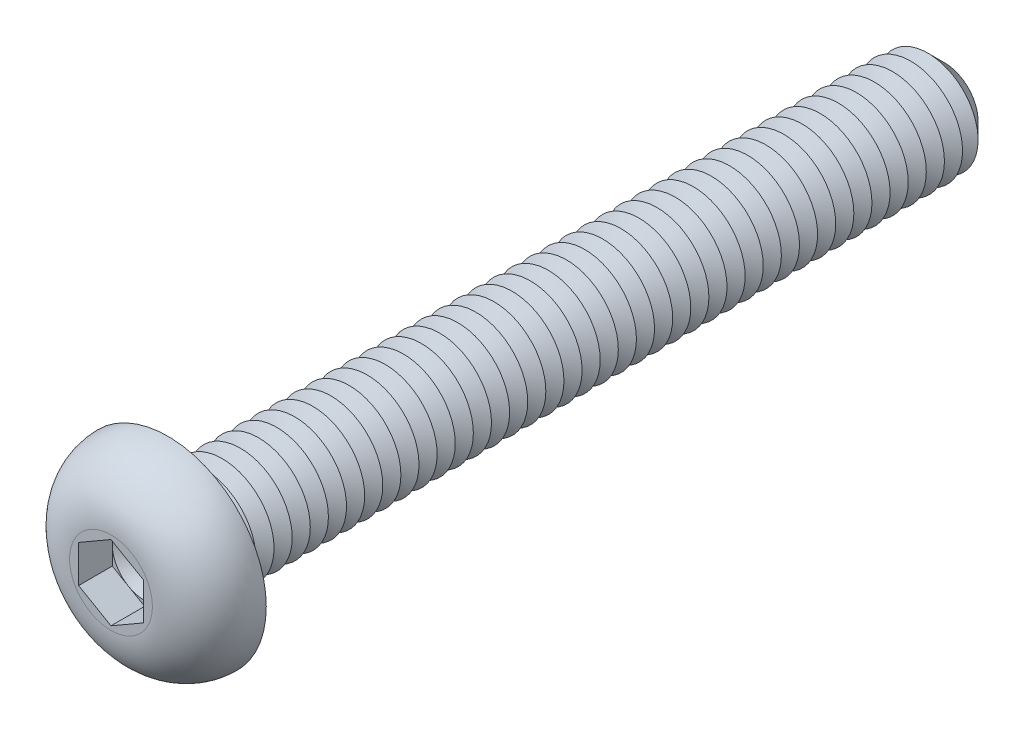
ISO-10303-21;
HEADER;
FILE_DESCRIPTION(('STEP AP214'),'2;1');
FILE_NAME('part.step','',(''),(''),'','','');
FILE_SCHEMA(('AUTOMOTIVE_DESIGN { 1 0 10303 214 1 1 1 1 }'));
ENDSEC;
DATA;
#1=APPLICATION_CONTEXT('core data for automotive mechanical design processes');
#2=APPLICATION_PROTOCOL_DEFINITION('international standard','automotive_design',2000,#1);
#3=PRODUCT_CONTEXT('',#1,'mechanical');
#4=PRODUCT('Part','Part','',(#3));
#5=PRODUCT_RELATED_PRODUCT_CATEGORY('part','',(#4));
#6=PRODUCT_DEFINITION_FORMATION('','',#4);
#7=PRODUCT_DEFINITION_CONTEXT('part definition',#1,'design');
#8=PRODUCT_DEFINITION('design','',#6,#7);
#9=PRODUCT_DEFINITION_SHAPE('','',#8);
#10=(LENGTH_UNIT() NAMED_UNIT(*) SI_UNIT(.MILLI.,.METRE.));
#11=(NAMED_UNIT(*) PLANE_ANGLE_UNIT() SI_UNIT($,.RADIAN.));
#12=(NAMED_UNIT(*) SI_UNIT($,.STERADIAN.) SOLID_ANGLE_UNIT());
#13=UNCERTAINTY_MEASURE_WITH_UNIT(LENGTH_MEASURE(1.E-05),#10,'distance_accuracy_value','');
#14=(GEOMETRIC_REPRESENTATION_CONTEXT(3) GLOBAL_UNCERTAINTY_ASSIGNED_CONTEXT((#13)) GLOBAL_UNIT_ASSIGNED_CONTEXT((#10,
#11,#12)) REPRESENTATION_CONTEXT('',''));
#15=CARTESIAN_POINT('',(0.,0.,0.));
#16=DIRECTION('',(0.,0.,1.));
#17=DIRECTION('',(1.,0.,0.));
#18=AXIS2_PLACEMENT_3D('',#15,#16,#17);
#19=CARTESIAN_POINT('',(0.,0.,0.900000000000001));
#20=DIRECTION('',(0.,0.,1.));
#21=DIRECTION('',(1.,0.,0.));
#22=AXIS2_PLACEMENT_3D('',#19,#20,#21);
#23=PLANE('',#22);
#24=CARTESIAN_POINT('',(0.,0.,0.900000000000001));
#25=DIRECTION('',(0.,0.,1.));
#26=DIRECTION('',(1.,0.,0.));
#27=AXIS2_PLACEMENT_3D('',#24,#25,#26);
#28=CIRCLE('',#27,1.25);
#29=CARTESIAN_POINT('',(1.25,0.,0.900000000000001));
#30=VERTEX_POINT('',#29);
#31=CARTESIAN_POINT('',(0.625,1.08253175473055,0.900000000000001));
#32=VERTEX_POINT('',#31);
#33=EDGE_CURVE('E117',#30,#32,#28,.T.);
#34=ORIENTED_EDGE('',*,*,#33,.F.);
#35=DIRECTION('',(0.,1.,0.));
#36=VECTOR('',#35,1.);
#37=CARTESIAN_POINT('',(1.25,-0.721687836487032,0.900000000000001));
#38=LINE('',#37,#36);
#39=CARTESIAN_POINT('',(1.25,0.721687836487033,0.900000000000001));
#40=VERTEX_POINT('',#39);
#41=EDGE_CURVE('E140',#30,#40,#38,.T.);
#42=ORIENTED_EDGE('',*,*,#41,.T.);
#43=DIRECTION('',(-0.866025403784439,0.5,0.));
#44=VECTOR('',#43,1.);
#45=CARTESIAN_POINT('',(1.25,0.721687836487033,0.900000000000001));
#46=LINE('',#45,#44);
#47=EDGE_CURVE('E135',#40,#32,#46,.T.);
#48=ORIENTED_EDGE('',*,*,#47,.T.);
#49=EDGE_LOOP('',(#34,#42,#48));
#50=FACE_BOUND('',#49,.T.);
#51=ADVANCED_FACE('F39',(#50),#23,.T.);
#52=CARTESIAN_POINT('',(0.,0.,0.900000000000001));
#53=DIRECTION('',(0.,0.,1.));
#54=DIRECTION('',(1.,0.,0.));
#55=AXIS2_PLACEMENT_3D('',#52,#53,#54);
#56=CIRCLE('',#55,1.25);
#57=CARTESIAN_POINT('',(-0.625,1.08253175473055,0.900000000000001));
#58=VERTEX_POINT('',#57);
#59=EDGE_CURVE('E11',#32,#58,#56,.T.);
#60=ORIENTED_EDGE('',*,*,#59,.F.);
#61=CARTESIAN_POINT('',(0.,1.44337567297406,0.900000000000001));
#62=VERTEX_POINT('',#61);
#63=EDGE_CURVE('E130',#32,#62,#46,.T.);
#64=ORIENTED_EDGE('',*,*,#63,.T.);
#65=DIRECTION('',(-0.866025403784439,-0.5,0.));
#66=VECTOR('',#65,1.);
#67=CARTESIAN_POINT('',(0.,1.44337567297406,0.900000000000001));
#68=LINE('',#67,#66);
#69=EDGE_CURVE('E132',#62,#58,#68,.T.);
#70=ORIENTED_EDGE('',*,*,#69,.T.);
#71=EDGE_LOOP('',(#60,#64,#70));
#72=FACE_BOUND('',#71,.T.);
#73=ADVANCED_FACE('F129',(#72),#23,.T.);
#74=CARTESIAN_POINT('',(-1.25,0.,0.900000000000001));
#75=VERTEX_POINT('',#74);
#76=EDGE_CURVE('E49',#58,#75,#56,.T.);
#77=ORIENTED_EDGE('',*,*,#76,.F.);
#78=CARTESIAN_POINT('',(-1.25,0.721687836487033,0.900000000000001));
#79=VERTEX_POINT('',#78);
#80=EDGE_CURVE('E143',#58,#79,#68,.T.);
#81=ORIENTED_EDGE('',*,*,#80,.T.);
#82=DIRECTION('',(0.,-1.,0.));
#83=VECTOR('',#82,1.);
#84=CARTESIAN_POINT('',(-1.25,0.721687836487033,0.900000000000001));
#85=LINE('',#84,#83);
#86=EDGE_CURVE('E154',#79,#75,#85,.T.);
#87=ORIENTED_EDGE('',*,*,#86,.T.);
#88=EDGE_LOOP('',(#77,#81,#87));
#89=FACE_BOUND('',#88,.T.);
#90=ADVANCED_FACE('F261',(#89),#23,.T.);
#91=CARTESIAN_POINT('',(-0.625,-1.08253175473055,0.900000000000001));
#92=VERTEX_POINT('',#91);
#93=EDGE_CURVE('E240',#75,#92,#56,.T.);
#94=ORIENTED_EDGE('',*,*,#93,.F.);
#95=CARTESIAN_POINT('',(-1.25,-0.721687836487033,0.900000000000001));
#96=VERTEX_POINT('',#95);
#97=EDGE_CURVE('E153',#75,#96,#85,.T.);
#98=ORIENTED_EDGE('',*,*,#97,.T.);
#99=DIRECTION('',(0.866025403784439,-0.5,0.));
#100=VECTOR('',#99,1.);
#101=CARTESIAN_POINT('',(-1.25,-0.721687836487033,0.900000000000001));
#102=LINE('',#101,#100);
#103=EDGE_CURVE('E159',#96,#92,#102,.T.);
#104=ORIENTED_EDGE('',*,*,#103,.T.);
#105=EDGE_LOOP('',(#94,#98,#104));
#106=FACE_BOUND('',#105,.T.);
#107=ADVANCED_FACE('F254',(#106),#23,.T.);
#108=CARTESIAN_POINT('',(0.625,-1.08253175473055,0.900000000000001));
#109=VERTEX_POINT('',#108);
#110=EDGE_CURVE('E56',#92,#109,#56,.T.);
#111=ORIENTED_EDGE('',*,*,#110,.F.);
#112=CARTESIAN_POINT('',(0.,-1.44337567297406,0.900000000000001));
#113=VERTEX_POINT('',#112);
#114=EDGE_CURVE('E158',#92,#113,#102,.T.);
#115=ORIENTED_EDGE('',*,*,#114,.T.);
#116=DIRECTION('',(0.866025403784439,0.5,0.));
#117=VECTOR('',#116,1.);
#118=CARTESIAN_POINT('',(0.,-1.44337567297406,0.900000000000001));
#119=LINE('',#118,#117);
#120=EDGE_CURVE('E164',#113,#109,#119,.T.);
#121=ORIENTED_EDGE('',*,*,#120,.T.);
#122=EDGE_LOOP('',(#111,#115,#121));
#123=FACE_BOUND('',#122,.T.);
#124=ADVANCED_FACE('F419',(#123),#23,.T.);
#125=CARTESIAN_POINT('',(0.,0.,-30.));
#126=DIRECTION('',(0.,0.,1.));
#127=DIRECTION('',(1.,0.,0.));
#128=AXIS2_PLACEMENT_3D('',#125,#126,#127);
#129=CYLINDRICAL_SURFACE('',#128,2.);
#130=CARTESIAN_POINT('',(0.,0.,-0.300000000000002));
#131=DIRECTION('',(0.,0.,1.));
#132=DIRECTION('',(1.,0.,0.));
#133=AXIS2_PLACEMENT_3D('',#130,#131,#132);
#134=CIRCLE('',#133,2.);
#135=CARTESIAN_POINT('',(2.,0.,-0.300000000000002));
#136=VERTEX_POINT('',#135);
#137=EDGE_CURVE('E222',#136,#136,#134,.F.);
#138=ORIENTED_EDGE('',*,*,#137,.T.);
#139=EDGE_LOOP('',(#138));
#140=FACE_BOUND('',#139,.T.);
#141=CARTESIAN_POINT('',(0.,0.,-0.699999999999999));
#142=DIRECTION('',(0.,0.,1.));
#143=DIRECTION('',(1.,0.,0.));
#144=AXIS2_PLACEMENT_3D('',#141,#142,#143);
#145=CIRCLE('',#144,2.);
#146=CARTESIAN_POINT('',(2.,0.,-0.699999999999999));
#147=VERTEX_POINT('',#146);
#148=EDGE_CURVE('E149',#147,#147,#145,.T.);
#149=ORIENTED_EDGE('',*,*,#148,.T.);
#150=EDGE_LOOP('',(#149));
#151=FACE_BOUND('',#150,.T.);
#152=ADVANCED_FACE('F403',(#140,#151),#129,.T.);
#153=CARTESIAN_POINT('',(0.,3.8,0.));
#154=DIRECTION('',(0.,0.,1.));
#155=DIRECTION('',(1.,0.,0.));
#156=AXIS2_PLACEMENT_3D('',#153,#154,#155);
#157=PLANE('',#156);
#158=CARTESIAN_POINT('',(0.,0.,0.));
#159=DIRECTION('',(0.,0.,1.));
#160=DIRECTION('',(1.,0.,0.));
#161=AXIS2_PLACEMENT_3D('',#158,#159,#160);
#162=CIRCLE('',#161,2.3);
#163=CARTESIAN_POINT('',(2.3,0.,0.));
#164=VERTEX_POINT('',#163);
#165=EDGE_CURVE('E231',#164,#164,#162,.T.);
#166=ORIENTED_EDGE('',*,*,#165,.T.);
#167=EDGE_LOOP('',(#166));
#168=FACE_BOUND('',#167,.T.);
#169=CARTESIAN_POINT('',(0.,0.,0.));
#170=DIRECTION('',(0.,0.,1.));
#171=DIRECTION('',(1.,0.,0.));
#172=AXIS2_PLACEMENT_3D('',#169,#170,#171);
#173=CIRCLE('',#172,3.8);
#174=CARTESIAN_POINT('',(3.8,0.,0.));
#175=VERTEX_POINT('',#174);
#176=EDGE_CURVE('E196',#175,#175,#173,.T.);
#177=ORIENTED_EDGE('',*,*,#176,.F.);
#178=EDGE_LOOP('',(#177));
#179=FACE_BOUND('',#178,.T.);
#180=ADVANCED_FACE('F449',(#168,#179),#157,.F.);
#181=CARTESIAN_POINT('',(0.,0.,2.2));
#182=DIRECTION('',(0.,0.,-1.));
#183=DIRECTION('',(-1.,0.,0.));
#184=AXIS2_PLACEMENT_3D('',#181,#182,#183);
#185=PLANE('',#184);
#186=DIRECTION('',(-0.866025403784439,-0.5,0.));
#187=VECTOR('',#186,1.);
#188=CARTESIAN_POINT('',(0.,1.44337567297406,2.2));
#189=LINE('',#188,#187);
#190=CARTESIAN_POINT('',(0.,1.44337567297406,2.2));
#191=VERTEX_POINT('',#190);
#192=CARTESIAN_POINT('',(-1.25,0.721687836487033,2.2));
#193=VERTEX_POINT('',#192);
#194=EDGE_CURVE('E174',#191,#193,#189,.T.);
#195=ORIENTED_EDGE('',*,*,#194,.F.);
#196=DIRECTION('',(-0.866025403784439,0.5,0.));
#197=VECTOR('',#196,1.);
#198=CARTESIAN_POINT('',(1.25,0.721687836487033,2.2));
#199=LINE('',#198,#197);
#200=CARTESIAN_POINT('',(1.25,0.721687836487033,2.2));
#201=VERTEX_POINT('',#200);
#202=EDGE_CURVE('E64',#201,#191,#199,.T.);
#203=ORIENTED_EDGE('',*,*,#202,.F.);
#204=DIRECTION('',(0.,1.,0.));
#205=VECTOR('',#204,1.);
#206=CARTESIAN_POINT('',(1.25,-0.721687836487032,2.2));
#207=LINE('',#206,#205);
#208=CARTESIAN_POINT('',(1.25,-0.721687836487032,2.2));
#209=VERTEX_POINT('',#208);
#210=EDGE_CURVE('E138',#209,#201,#207,.T.);
#211=ORIENTED_EDGE('',*,*,#210,.F.);
#212=DIRECTION('',(0.866025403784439,0.5,0.));
#213=VECTOR('',#212,1.);
#214=CARTESIAN_POINT('',(0.,-1.44337567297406,2.2));
#215=LINE('',#214,#213);
#216=CARTESIAN_POINT('',(0.,-1.44337567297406,2.2));
#217=VERTEX_POINT('',#216);
#218=EDGE_CURVE('E186',#217,#209,#215,.T.);
#219=ORIENTED_EDGE('',*,*,#218,.F.);
#220=DIRECTION('',(0.866025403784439,-0.5,0.));
#221=VECTOR('',#220,1.);
#222=CARTESIAN_POINT('',(-1.25,-0.721687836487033,2.2));
#223=LINE('',#222,#221);
#224=CARTESIAN_POINT('',(-1.25,-0.721687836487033,2.2));
#225=VERTEX_POINT('',#224);
#226=EDGE_CURVE('E182',#225,#217,#223,.T.);
#227=ORIENTED_EDGE('',*,*,#226,.F.);
#228=DIRECTION('',(0.,-1.,0.));
#229=VECTOR('',#228,1.);
#230=CARTESIAN_POINT('',(-1.25,0.721687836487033,2.2));
#231=LINE('',#230,#229);
#232=EDGE_CURVE('E178',#193,#225,#231,.T.);
#233=ORIENTED_EDGE('',*,*,#232,.F.);
#234=EDGE_LOOP('',(#195,#203,#211,#219,#227,#233));
#235=FACE_BOUND('',#234,.T.);
#236=CARTESIAN_POINT('',(0.,0.,2.2));
#237=DIRECTION('',(0.,0.,1.));
#238=DIRECTION('',(1.,0.,0.));
#239=AXIS2_PLACEMENT_3D('',#236,#237,#238);
#240=CIRCLE('',#239,1.6);
#241=CARTESIAN_POINT('',(1.6,0.,2.2));
#242=VERTEX_POINT('',#241);
#243=EDGE_CURVE('E214',#242,#242,#240,.T.);
#244=ORIENTED_EDGE('',*,*,#243,.T.);
#245=EDGE_LOOP('',(#244));
#246=FACE_BOUND('',#245,.T.);
#247=ADVANCED_FACE('F270',(#235,#246),#185,.F.);
#248=CARTESIAN_POINT('',(0.,0.,0.));
#249=DIRECTION('',(0.,0.,1.));
#250=DIRECTION('',(1.,0.,0.));
#251=AXIS2_PLACEMENT_3D('',#248,#249,#250);
#252=DEGENERATE_TOROIDAL_SURFACE('',#251,1.6,2.2,.T.);
#253=ORIENTED_EDGE('',*,*,#243,.F.);
#254=EDGE_LOOP('',(#253));
#255=FACE_BOUND('',#254,.T.);
#256=ORIENTED_EDGE('',*,*,#176,.T.);
#257=EDGE_LOOP('',(#256));
#258=FACE_BOUND('',#257,.T.);
#259=ADVANCED_FACE('F443',(#255,#258),#252,.T.);
#260=CARTESIAN_POINT('',(1.25,0.721687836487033,0.900000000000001));
#261=DIRECTION('',(0.5,0.866025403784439,0.));
#262=DIRECTION('',(-0.866025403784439,0.5,0.));
#263=AXIS2_PLACEMENT_3D('',#260,#261,#262);
#264=PLANE('',#263);
#265=ORIENTED_EDGE('',*,*,#202,.T.);
#266=DIRECTION('',(0.,0.,1.));
#267=VECTOR('',#266,1.);
#268=CARTESIAN_POINT('',(0.,1.44337567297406,0.900000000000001));
#269=LINE('',#268,#267);
#270=EDGE_CURVE('E136',#62,#191,#269,.T.);
#271=ORIENTED_EDGE('',*,*,#270,.F.);
#272=ORIENTED_EDGE('',*,*,#63,.F.);
#273=ORIENTED_EDGE('',*,*,#47,.F.);
#274=DIRECTION('',(0.,0.,1.));
#275=VECTOR('',#274,1.);
#276=CARTESIAN_POINT('',(1.25,0.721687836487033,0.900000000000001));
#277=LINE('',#276,#275);
#278=EDGE_CURVE('E193',#40,#201,#277,.T.);
#279=ORIENTED_EDGE('',*,*,#278,.T.);
#280=EDGE_LOOP('',(#265,#271,#272,#273,#279));
#281=FACE_BOUND('',#280,.T.);
#282=ADVANCED_FACE('F134',(#281),#264,.F.);
#283=CARTESIAN_POINT('',(1.25,-0.721687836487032,0.900000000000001));
#284=DIRECTION('',(1.,0.,0.));
#285=DIRECTION('',(0.,1.,0.));
#286=AXIS2_PLACEMENT_3D('',#283,#284,#285);
#287=PLANE('',#286);
#288=ORIENTED_EDGE('',*,*,#210,.T.);
#289=ORIENTED_EDGE('',*,*,#278,.F.);
#290=ORIENTED_EDGE('',*,*,#41,.F.);
#291=CARTESIAN_POINT('',(1.25,-0.721687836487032,0.900000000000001));
#292=VERTEX_POINT('',#291);
#293=EDGE_CURVE('E168',#292,#30,#38,.T.);
#294=ORIENTED_EDGE('',*,*,#293,.F.);
#295=DIRECTION('',(0.,0.,1.));
#296=VECTOR('',#295,1.);
#297=CARTESIAN_POINT('',(1.25,-0.721687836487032,0.900000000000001));
#298=LINE('',#297,#296);
#299=EDGE_CURVE('E197',#292,#209,#298,.T.);
#300=ORIENTED_EDGE('',*,*,#299,.T.);
#301=EDGE_LOOP('',(#288,#289,#290,#294,#300));
#302=FACE_BOUND('',#301,.T.);
#303=ADVANCED_FACE('F427',(#302),#287,.F.);
#304=CARTESIAN_POINT('',(0.,-1.44337567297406,0.900000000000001));
#305=DIRECTION('',(0.5,-0.866025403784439,0.));
#306=DIRECTION('',(0.866025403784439,0.5,0.));
#307=AXIS2_PLACEMENT_3D('',#304,#305,#306);
#308=PLANE('',#307);
#309=ORIENTED_EDGE('',*,*,#218,.T.);
#310=ORIENTED_EDGE('',*,*,#299,.F.);
#311=EDGE_CURVE('E163',#109,#292,#119,.T.);
#312=ORIENTED_EDGE('',*,*,#311,.F.);
#313=ORIENTED_EDGE('',*,*,#120,.F.);
#314=DIRECTION('',(0.,0.,1.));
#315=VECTOR('',#314,1.);
#316=CARTESIAN_POINT('',(0.,-1.44337567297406,0.900000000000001));
#317=LINE('',#316,#315);
#318=EDGE_CURVE('E200',#113,#217,#317,.T.);
#319=ORIENTED_EDGE('',*,*,#318,.T.);
#320=EDGE_LOOP('',(#309,#310,#312,#313,#319));
#321=FACE_BOUND('',#320,.T.);
#322=ADVANCED_FACE('F430',(#321),#308,.F.);
#323=CARTESIAN_POINT('',(-1.25,-0.721687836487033,0.900000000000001));
#324=DIRECTION('',(-0.5,-0.866025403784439,0.));
#325=DIRECTION('',(0.866025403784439,-0.5,0.));
#326=AXIS2_PLACEMENT_3D('',#323,#324,#325);
#327=PLANE('',#326);
#328=ORIENTED_EDGE('',*,*,#226,.T.);
#329=ORIENTED_EDGE('',*,*,#318,.F.);
#330=ORIENTED_EDGE('',*,*,#114,.F.);
#331=ORIENTED_EDGE('',*,*,#103,.F.);
#332=DIRECTION('',(0.,0.,1.));
#333=VECTOR('',#332,1.);
#334=CARTESIAN_POINT('',(-1.25,-0.721687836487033,0.900000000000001));
#335=LINE('',#334,#333);
#336=EDGE_CURVE('E203',#96,#225,#335,.T.);
#337=ORIENTED_EDGE('',*,*,#336,.T.);
#338=EDGE_LOOP('',(#328,#329,#330,#331,#337));
#339=FACE_BOUND('',#338,.T.);
#340=ADVANCED_FACE('F275',(#339),#327,.F.);
#341=CARTESIAN_POINT('',(-1.25,0.721687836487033,0.900000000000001));
#342=DIRECTION('',(-1.,0.,0.));
#343=DIRECTION('',(0.,0.,1.));
#344=AXIS2_PLACEMENT_3D('',#341,#342,#343);
#345=PLANE('',#344);
#346=ORIENTED_EDGE('',*,*,#232,.T.);
#347=ORIENTED_EDGE('',*,*,#336,.F.);
#348=ORIENTED_EDGE('',*,*,#97,.F.);
#349=ORIENTED_EDGE('',*,*,#86,.F.);
#350=DIRECTION('',(0.,0.,1.));
#351=VECTOR('',#350,1.);
#352=CARTESIAN_POINT('',(-1.25,0.721687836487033,0.900000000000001));
#353=LINE('',#352,#351);
#354=EDGE_CURVE('E206',#79,#193,#353,.T.);
#355=ORIENTED_EDGE('',*,*,#354,.T.);
#356=EDGE_LOOP('',(#346,#347,#348,#349,#355));
#357=FACE_BOUND('',#356,.T.);
#358=ADVANCED_FACE('F259',(#357),#345,.F.);
#359=CARTESIAN_POINT('',(0.,1.44337567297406,0.900000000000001));
#360=DIRECTION('',(-0.5,0.866025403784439,0.));
#361=DIRECTION('',(-0.866025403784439,-0.5,0.));
#362=AXIS2_PLACEMENT_3D('',#359,#360,#361);
#363=PLANE('',#362);
#364=ORIENTED_EDGE('',*,*,#194,.T.);
#365=ORIENTED_EDGE('',*,*,#354,.F.);
#366=ORIENTED_EDGE('',*,*,#80,.F.);
#367=ORIENTED_EDGE('',*,*,#69,.F.);
#368=ORIENTED_EDGE('',*,*,#270,.T.);
#369=EDGE_LOOP('',(#364,#365,#366,#367,#368));
#370=FACE_BOUND('',#369,.T.);
#371=ADVANCED_FACE('F264',(#370),#363,.F.);
#372=EDGE_CURVE('E43',#109,#30,#56,.T.);
#373=ORIENTED_EDGE('',*,*,#372,.F.);
#374=ORIENTED_EDGE('',*,*,#311,.T.);
#375=ORIENTED_EDGE('',*,*,#293,.T.);
#376=EDGE_LOOP('',(#373,#374,#375));
#377=FACE_BOUND('',#376,.T.);
#378=ADVANCED_FACE('F408',(#377),#23,.T.);
#379=CARTESIAN_POINT('',(0.,0.,-0.699999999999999));
#380=DIRECTION('',(0.,0.,1.));
#381=DIRECTION('',(1.,0.,0.));
#382=AXIS2_PLACEMENT_3D('',#379,#380,#381);
#383=CONICAL_SURFACE('',#382,2.,1.04719755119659);
#384=CARTESIAN_POINT('',(0.,0.,-1.05));
#385=DIRECTION('',(0.,0.,1.));
#386=DIRECTION('',(1.,0.,0.));
#387=AXIS2_PLACEMENT_3D('',#384,#385,#386);
#388=CIRCLE('',#387,1.3937822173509);
#389=CARTESIAN_POINT('',(1.3937822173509,0.,-1.05));
#390=VERTEX_POINT('',#389);
#391=EDGE_CURVE('E394',#390,#390,#388,.T.);
#392=ORIENTED_EDGE('',*,*,#391,.T.);
#393=EDGE_LOOP('',(#392));
#394=FACE_BOUND('',#393,.T.);
#395=ORIENTED_EDGE('',*,*,#148,.F.);
#396=EDGE_LOOP('',(#395));
#397=FACE_BOUND('',#396,.T.);
#398=ADVANCED_FACE('F405',(#394,#397),#383,.T.);
#399=CARTESIAN_POINT('',(0.,0.,-1.05));
#400=DIRECTION('',(0.,0.,-1.));
#401=DIRECTION('',(-1.,0.,0.));
#402=AXIS2_PLACEMENT_3D('',#399,#400,#401);
#403=CONICAL_SURFACE('',#402,1.3937822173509,1.0471975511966);
#404=CARTESIAN_POINT('',(0.,0.,-1.4));
#405=DIRECTION('',(0.,0.,1.));
#406=DIRECTION('',(1.,0.,0.));
#407=AXIS2_PLACEMENT_3D('',#404,#405,#406);
#408=CIRCLE('',#407,2.);
#409=CARTESIAN_POINT('',(2.,0.,-1.4));
#410=VERTEX_POINT('',#409);
#411=EDGE_CURVE('E391',#410,#410,#408,.T.);
#412=ORIENTED_EDGE('',*,*,#411,.T.);
#413=EDGE_LOOP('',(#412));
#414=FACE_BOUND('',#413,.T.);
#415=ORIENTED_EDGE('',*,*,#391,.F.);
#416=EDGE_LOOP('',(#415));
#417=FACE_BOUND('',#416,.T.);
#418=ADVANCED_FACE('F407',(#414,#417),#403,.T.);
#419=CARTESIAN_POINT('',(0.,0.,-1.4));
#420=DIRECTION('',(0.,0.,1.));
#421=DIRECTION('',(1.,0.,0.));
#422=AXIS2_PLACEMENT_3D('',#419,#420,#421);
#423=CONICAL_SURFACE('',#422,2.,1.04719755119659);
#424=CARTESIAN_POINT('',(0.,0.,-1.75));
#425=DIRECTION('',(0.,0.,1.));
#426=DIRECTION('',(1.,0.,0.));
#427=AXIS2_PLACEMENT_3D('',#424,#425,#426);
#428=CIRCLE('',#427,1.3937822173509);
#429=CARTESIAN_POINT('',(1.3937822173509,0.,-1.75));
#430=VERTEX_POINT('',#429);
#431=EDGE_CURVE('E387',#430,#430,#428,.T.);
#432=ORIENTED_EDGE('',*,*,#431,.T.);
#433=EDGE_LOOP('',(#432));
#434=FACE_BOUND('',#433,.T.);
#435=ORIENTED_EDGE('',*,*,#411,.F.);
#436=EDGE_LOOP('',(#435));
#437=FACE_BOUND('',#436,.T.);
#438=ADVANCED_FACE('F414',(#434,#437),#423,.T.);
#439=CARTESIAN_POINT('',(0.,0.,-1.75));
#440=DIRECTION('',(0.,0.,-1.));
#441=DIRECTION('',(-1.,0.,0.));
#442=AXIS2_PLACEMENT_3D('',#439,#440,#441);
#443=CONICAL_SURFACE('',#442,1.3937822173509,1.0471975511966);
#444=CARTESIAN_POINT('',(0.,0.,-2.1));
#445=DIRECTION('',(0.,0.,1.));
#446=DIRECTION('',(1.,0.,0.));
#447=AXIS2_PLACEMENT_3D('',#444,#445,#446);
#448=CIRCLE('',#447,2.);
#449=CARTESIAN_POINT('',(2.,0.,-2.1));
#450=VERTEX_POINT('',#449);
#451=EDGE_CURVE('E319',#450,#450,#448,.T.);
#452=ORIENTED_EDGE('',*,*,#451,.T.);
#453=EDGE_LOOP('',(#452));
#454=FACE_BOUND('',#453,.T.);
#455=ORIENTED_EDGE('',*,*,#431,.F.);
#456=EDGE_LOOP('',(#455));
#457=FACE_BOUND('',#456,.T.);
#458=ADVANCED_FACE('F763',(#454,#457),#443,.T.);
#459=CARTESIAN_POINT('',(0.,0.,-2.1));
#460=DIRECTION('',(0.,0.,1.));
#461=DIRECTION('',(1.,0.,0.));
#462=AXIS2_PLACEMENT_3D('',#459,#460,#461);
#463=CONICAL_SURFACE('',#462,2.,1.04719755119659);
#464=CARTESIAN_POINT('',(0.,0.,-2.45));
#465=DIRECTION('',(0.,0.,1.));
#466=DIRECTION('',(1.,0.,0.));
#467=AXIS2_PLACEMENT_3D('',#464,#465,#466);
#468=CIRCLE('',#467,1.3937822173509);
#469=CARTESIAN_POINT('',(1.3937822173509,0.,-2.45));
#470=VERTEX_POINT('',#469);
#471=EDGE_CURVE('E316',#470,#470,#468,.T.);
#472=ORIENTED_EDGE('',*,*,#471,.T.);
#473=EDGE_LOOP('',(#472));
#474=FACE_BOUND('',#473,.T.);
#475=ORIENTED_EDGE('',*,*,#451,.F.);
#476=EDGE_LOOP('',(#475));
#477=FACE_BOUND('',#476,.T.);
#478=ADVANCED_FACE('F759',(#474,#477),#463,.T.);
#479=CARTESIAN_POINT('',(0.,0.,-2.45));
#480=DIRECTION('',(0.,0.,-1.));
#481=DIRECTION('',(-1.,0.,0.));
#482=AXIS2_PLACEMENT_3D('',#479,#480,#481);
#483=CONICAL_SURFACE('',#482,1.3937822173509,1.0471975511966);
#484=CARTESIAN_POINT('',(0.,0.,-2.8));
#485=DIRECTION('',(0.,0.,1.));
#486=DIRECTION('',(1.,0.,0.));
#487=AXIS2_PLACEMENT_3D('',#484,#485,#486);
#488=CIRCLE('',#487,2.);
#489=CARTESIAN_POINT('',(2.,0.,-2.8));
#490=VERTEX_POINT('',#489);
#491=EDGE_CURVE('E320',#490,#490,#488,.T.);
#492=ORIENTED_EDGE('',*,*,#491,.T.);
#493=EDGE_LOOP('',(#492));
#494=FACE_BOUND('',#493,.T.);
#495=ORIENTED_EDGE('',*,*,#471,.F.);
#496=EDGE_LOOP('',(#495));
#497=FACE_BOUND('',#496,.T.);
#498=ADVANCED_FACE('F755',(#494,#497),#483,.T.);
#499=CARTESIAN_POINT('',(0.,0.,-2.8));
#500=DIRECTION('',(0.,0.,1.));
#501=DIRECTION('',(1.,0.,0.));
#502=AXIS2_PLACEMENT_3D('',#499,#500,#501);
#503=CONICAL_SURFACE('',#502,2.,1.04719755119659);
#504=CARTESIAN_POINT('',(0.,0.,-3.15));
#505=DIRECTION('',(0.,0.,1.));
#506=DIRECTION('',(1.,0.,0.));
#507=AXIS2_PLACEMENT_3D('',#504,#505,#506);
#508=CIRCLE('',#507,1.3937822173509);
#509=CARTESIAN_POINT('',(1.3937822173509,0.,-3.15));
#510=VERTEX_POINT('',#509);
#511=EDGE_CURVE('E313',#510,#510,#508,.T.);
#512=ORIENTED_EDGE('',*,*,#511,.T.);
#513=EDGE_LOOP('',(#512));
#514=FACE_BOUND('',#513,.T.);
#515=ORIENTED_EDGE('',*,*,#491,.F.);
#516=EDGE_LOOP('',(#515));
#517=FACE_BOUND('',#516,.T.);
#518=ADVANCED_FACE('F751',(#514,#517),#503,.T.);
#519=CARTESIAN_POINT('',(0.,0.,-3.15));
#520=DIRECTION('',(0.,0.,-1.));
#521=DIRECTION('',(-1.,0.,0.));
#522=AXIS2_PLACEMENT_3D('',#519,#520,#521);
#523=CONICAL_SURFACE('',#522,1.3937822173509,1.0471975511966);
#524=CARTESIAN_POINT('',(0.,0.,-3.5));
#525=DIRECTION('',(0.,0.,1.));
#526=DIRECTION('',(1.,0.,0.));
#527=AXIS2_PLACEMENT_3D('',#524,#525,#526);
#528=CIRCLE('',#527,2.);
#529=CARTESIAN_POINT('',(2.,0.,-3.5));
#530=VERTEX_POINT('',#529);
#531=EDGE_CURVE('E310',#530,#530,#528,.T.);
#532=ORIENTED_EDGE('',*,*,#531,.T.);
#533=EDGE_LOOP('',(#532));
#534=FACE_BOUND('',#533,.T.);
#535=ORIENTED_EDGE('',*,*,#511,.F.);
#536=EDGE_LOOP('',(#535));
#537=FACE_BOUND('',#536,.T.);
#538=ADVANCED_FACE('F747',(#534,#537),#523,.T.);
#539=CARTESIAN_POINT('',(0.,0.,-3.5));
#540=DIRECTION('',(0.,0.,1.));
#541=DIRECTION('',(1.,0.,0.));
#542=AXIS2_PLACEMENT_3D('',#539,#540,#541);
#543=CONICAL_SURFACE('',#542,2.,1.04719755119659);
#544=CARTESIAN_POINT('',(0.,0.,-3.85));
#545=DIRECTION('',(0.,0.,1.));
#546=DIRECTION('',(1.,0.,0.));
#547=AXIS2_PLACEMENT_3D('',#544,#545,#546);
#548=CIRCLE('',#547,1.3937822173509);
#549=CARTESIAN_POINT('',(1.3937822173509,0.,-3.85));
#550=VERTEX_POINT('',#549);
#551=EDGE_CURVE('E314',#550,#550,#548,.T.);
#552=ORIENTED_EDGE('',*,*,#551,.T.);
#553=EDGE_LOOP('',(#552));
#554=FACE_BOUND('',#553,.T.);
#555=ORIENTED_EDGE('',*,*,#531,.F.);
#556=EDGE_LOOP('',(#555));
#557=FACE_BOUND('',#556,.T.);
#558=ADVANCED_FACE('F743',(#554,#557),#543,.T.);
#559=CARTESIAN_POINT('',(0.,0.,-3.85));
#560=DIRECTION('',(0.,0.,-1.));
#561=DIRECTION('',(-1.,0.,0.));
#562=AXIS2_PLACEMENT_3D('',#559,#560,#561);
#563=CONICAL_SURFACE('',#562,1.3937822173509,1.0471975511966);
#564=CARTESIAN_POINT('',(0.,0.,-4.2));
#565=DIRECTION('',(0.,0.,1.));
#566=DIRECTION('',(1.,0.,0.));
#567=AXIS2_PLACEMENT_3D('',#564,#565,#566);
#568=CIRCLE('',#567,2.);
#569=CARTESIAN_POINT('',(2.,0.,-4.2));
#570=VERTEX_POINT('',#569);
#571=EDGE_CURVE('E371',#570,#570,#568,.T.);
#572=ORIENTED_EDGE('',*,*,#571,.T.);
#573=EDGE_LOOP('',(#572));
#574=FACE_BOUND('',#573,.T.);
#575=ORIENTED_EDGE('',*,*,#551,.F.);
#576=EDGE_LOOP('',(#575));
#577=FACE_BOUND('',#576,.T.);
#578=ADVANCED_FACE('F739',(#574,#577),#563,.T.);
#579=CARTESIAN_POINT('',(0.,0.,-4.2));
#580=DIRECTION('',(0.,0.,1.));
#581=DIRECTION('',(1.,0.,0.));
#582=AXIS2_PLACEMENT_3D('',#579,#580,#581);
#583=CONICAL_SURFACE('',#582,2.,1.04719755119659);
#584=CARTESIAN_POINT('',(0.,0.,-4.55));
#585=DIRECTION('',(0.,0.,1.));
#586=DIRECTION('',(1.,0.,0.));
#587=AXIS2_PLACEMENT_3D('',#584,#585,#586);
#588=CIRCLE('',#587,1.3937822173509);
#589=CARTESIAN_POINT('',(1.3937822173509,0.,-4.55));
#590=VERTEX_POINT('',#589);
#591=EDGE_CURVE('E367',#590,#590,#588,.T.);
#592=ORIENTED_EDGE('',*,*,#591,.T.);
#593=EDGE_LOOP('',(#592));
#594=FACE_BOUND('',#593,.T.);
#595=ORIENTED_EDGE('',*,*,#571,.F.);
#596=EDGE_LOOP('',(#595));
#597=FACE_BOUND('',#596,.T.);
#598=ADVANCED_FACE('F735',(#594,#597),#583,.T.);
#599=CARTESIAN_POINT('',(0.,0.,-4.55));
#600=DIRECTION('',(0.,0.,-1.));
#601=DIRECTION('',(-1.,0.,0.));
#602=AXIS2_PLACEMENT_3D('',#599,#600,#601);
#603=CONICAL_SURFACE('',#602,1.3937822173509,1.0471975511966);
#604=CARTESIAN_POINT('',(0.,0.,-4.9));
#605=DIRECTION('',(0.,0.,1.));
#606=DIRECTION('',(1.,0.,0.));
#607=AXIS2_PLACEMENT_3D('',#604,#605,#606);
#608=CIRCLE('',#607,2.);
#609=CARTESIAN_POINT('',(2.,0.,-4.9));
#610=VERTEX_POINT('',#609);
#611=EDGE_CURVE('E364',#610,#610,#608,.T.);
#612=ORIENTED_EDGE('',*,*,#611,.T.);
#613=EDGE_LOOP('',(#612));
#614=FACE_BOUND('',#613,.T.);
#615=ORIENTED_EDGE('',*,*,#591,.F.);
#616=EDGE_LOOP('',(#615));
#617=FACE_BOUND('',#616,.T.);
#618=ADVANCED_FACE('F731',(#614,#617),#603,.T.);
#619=CARTESIAN_POINT('',(0.,0.,-4.9));
#620=DIRECTION('',(0.,0.,1.));
#621=DIRECTION('',(1.,0.,0.));
#622=AXIS2_PLACEMENT_3D('',#619,#620,#621);
#623=CONICAL_SURFACE('',#622,2.,1.04719755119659);
#624=CARTESIAN_POINT('',(0.,0.,-5.25));
#625=DIRECTION('',(0.,0.,1.));
#626=DIRECTION('',(1.,0.,0.));
#627=AXIS2_PLACEMENT_3D('',#624,#625,#626);
#628=CIRCLE('',#627,1.3937822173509);
#629=CARTESIAN_POINT('',(1.3937822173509,0.,-5.25));
#630=VERTEX_POINT('',#629);
#631=EDGE_CURVE('E307',#630,#630,#628,.T.);
#632=ORIENTED_EDGE('',*,*,#631,.T.);
#633=EDGE_LOOP('',(#632));
#634=FACE_BOUND('',#633,.T.);
#635=ORIENTED_EDGE('',*,*,#611,.F.);
#636=EDGE_LOOP('',(#635));
#637=FACE_BOUND('',#636,.T.);
#638=ADVANCED_FACE('F727',(#634,#637),#623,.T.);
#639=CARTESIAN_POINT('',(0.,0.,-5.25));
#640=DIRECTION('',(0.,0.,-1.));
#641=DIRECTION('',(-1.,0.,0.));
#642=AXIS2_PLACEMENT_3D('',#639,#640,#641);
#643=CONICAL_SURFACE('',#642,1.3937822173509,1.0471975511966);
#644=CARTESIAN_POINT('',(0.,0.,-5.6));
#645=DIRECTION('',(0.,0.,1.));
#646=DIRECTION('',(1.,0.,0.));
#647=AXIS2_PLACEMENT_3D('',#644,#645,#646);
#648=CIRCLE('',#647,2.);
#649=CARTESIAN_POINT('',(2.,0.,-5.6));
#650=VERTEX_POINT('',#649);
#651=EDGE_CURVE('E304',#650,#650,#648,.T.);
#652=ORIENTED_EDGE('',*,*,#651,.T.);
#653=EDGE_LOOP('',(#652));
#654=FACE_BOUND('',#653,.T.);
#655=ORIENTED_EDGE('',*,*,#631,.F.);
#656=EDGE_LOOP('',(#655));
#657=FACE_BOUND('',#656,.T.);
#658=ADVANCED_FACE('F723',(#654,#657),#643,.T.);
#659=CARTESIAN_POINT('',(0.,0.,-5.6));
#660=DIRECTION('',(0.,0.,1.));
#661=DIRECTION('',(1.,0.,0.));
#662=AXIS2_PLACEMENT_3D('',#659,#660,#661);
#663=CONICAL_SURFACE('',#662,2.,1.04719755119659);
#664=CARTESIAN_POINT('',(0.,0.,-5.95));
#665=DIRECTION('',(0.,0.,1.));
#666=DIRECTION('',(1.,0.,0.));
#667=AXIS2_PLACEMENT_3D('',#664,#665,#666);
#668=CIRCLE('',#667,1.3937822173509);
#669=CARTESIAN_POINT('',(1.3937822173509,0.,-5.95));
#670=VERTEX_POINT('',#669);
#671=EDGE_CURVE('E308',#670,#670,#668,.T.);
#672=ORIENTED_EDGE('',*,*,#671,.T.);
#673=EDGE_LOOP('',(#672));
#674=FACE_BOUND('',#673,.T.);
#675=ORIENTED_EDGE('',*,*,#651,.F.);
#676=EDGE_LOOP('',(#675));
#677=FACE_BOUND('',#676,.T.);
#678=ADVANCED_FACE('F719',(#674,#677),#663,.T.);
#679=CARTESIAN_POINT('',(0.,0.,-5.95));
#680=DIRECTION('',(0.,0.,-1.));
#681=DIRECTION('',(-1.,0.,0.));
#682=AXIS2_PLACEMENT_3D('',#679,#680,#681);
#683=CONICAL_SURFACE('',#682,1.3937822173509,1.0471975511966);
#684=CARTESIAN_POINT('',(0.,0.,-6.3));
#685=DIRECTION('',(0.,0.,1.));
#686=DIRECTION('',(1.,0.,0.));
#687=AXIS2_PLACEMENT_3D('',#684,#685,#686);
#688=CIRCLE('',#687,2.);
#689=CARTESIAN_POINT('',(2.,0.,-6.3));
#690=VERTEX_POINT('',#689);
#691=EDGE_CURVE('E356',#690,#690,#688,.T.);
#692=ORIENTED_EDGE('',*,*,#691,.T.);
#693=EDGE_LOOP('',(#692));
#694=FACE_BOUND('',#693,.T.);
#695=ORIENTED_EDGE('',*,*,#671,.F.);
#696=EDGE_LOOP('',(#695));
#697=FACE_BOUND('',#696,.T.);
#698=ADVANCED_FACE('F715',(#694,#697),#683,.T.);
#699=CARTESIAN_POINT('',(0.,0.,-6.3));
#700=DIRECTION('',(0.,0.,1.));
#701=DIRECTION('',(1.,0.,0.));
#702=AXIS2_PLACEMENT_3D('',#699,#700,#701);
#703=CONICAL_SURFACE('',#702,2.,1.04719755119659);
#704=CARTESIAN_POINT('',(0.,0.,-6.65));
#705=DIRECTION('',(0.,0.,1.));
#706=DIRECTION('',(1.,0.,0.));
#707=AXIS2_PLACEMENT_3D('',#704,#705,#706);
#708=CIRCLE('',#707,1.3937822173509);
#709=CARTESIAN_POINT('',(1.3937822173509,0.,-6.65));
#710=VERTEX_POINT('',#709);
#711=EDGE_CURVE('E347',#710,#710,#708,.T.);
#712=ORIENTED_EDGE('',*,*,#711,.T.);
#713=EDGE_LOOP('',(#712));
#714=FACE_BOUND('',#713,.T.);
#715=ORIENTED_EDGE('',*,*,#691,.F.);
#716=EDGE_LOOP('',(#715));
#717=FACE_BOUND('',#716,.T.);
#718=ADVANCED_FACE('F711',(#714,#717),#703,.T.);
#719=CARTESIAN_POINT('',(0.,0.,-6.65));
#720=DIRECTION('',(0.,0.,-1.));
#721=DIRECTION('',(-1.,0.,0.));
#722=AXIS2_PLACEMENT_3D('',#719,#720,#721);
#723=CONICAL_SURFACE('',#722,1.3937822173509,1.0471975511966);
#724=CARTESIAN_POINT('',(0.,0.,-7.));
#725=DIRECTION('',(0.,0.,1.));
#726=DIRECTION('',(1.,0.,0.));
#727=AXIS2_PLACEMENT_3D('',#724,#725,#726);
#728=CIRCLE('',#727,2.);
#729=CARTESIAN_POINT('',(2.,0.,-7.));
#730=VERTEX_POINT('',#729);
#731=EDGE_CURVE('E341',#730,#730,#728,.T.);
#732=ORIENTED_EDGE('',*,*,#731,.T.);
#733=EDGE_LOOP('',(#732));
#734=FACE_BOUND('',#733,.T.);
#735=ORIENTED_EDGE('',*,*,#711,.F.);
#736=EDGE_LOOP('',(#735));
#737=FACE_BOUND('',#736,.T.);
#738=ADVANCED_FACE('F708',(#734,#737),#723,.T.);
#739=CARTESIAN_POINT('',(0.,0.,-7.));
#740=DIRECTION('',(0.,0.,1.));
#741=DIRECTION('',(1.,0.,0.));
#742=AXIS2_PLACEMENT_3D('',#739,#740,#741);
#743=CONICAL_SURFACE('',#742,2.,1.04719755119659);
#744=CARTESIAN_POINT('',(0.,0.,-7.35));
#745=DIRECTION('',(0.,0.,1.));
#746=DIRECTION('',(1.,0.,0.));
#747=AXIS2_PLACEMENT_3D('',#744,#745,#746);
#748=CIRCLE('',#747,1.3937822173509);
#749=CARTESIAN_POINT('',(1.3937822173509,0.,-7.35));
#750=VERTEX_POINT('',#749);
#751=EDGE_CURVE('E339',#750,#750,#748,.T.);
#752=ORIENTED_EDGE('',*,*,#751,.T.);
#753=EDGE_LOOP('',(#752));
#754=FACE_BOUND('',#753,.T.);
#755=ORIENTED_EDGE('',*,*,#731,.F.);
#756=EDGE_LOOP('',(#755));
#757=FACE_BOUND('',#756,.T.);
#758=ADVANCED_FACE('F704',(#754,#757),#743,.T.);
#759=CARTESIAN_POINT('',(0.,0.,-7.35));
#760=DIRECTION('',(0.,0.,-1.));
#761=DIRECTION('',(-1.,0.,0.));
#762=AXIS2_PLACEMENT_3D('',#759,#760,#761);
#763=CONICAL_SURFACE('',#762,1.3937822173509,1.0471975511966);
#764=CARTESIAN_POINT('',(0.,0.,-7.7));
#765=DIRECTION('',(0.,0.,1.));
#766=DIRECTION('',(1.,0.,0.));
#767=AXIS2_PLACEMENT_3D('',#764,#765,#766);
#768=CIRCLE('',#767,2.);
#769=CARTESIAN_POINT('',(2.,0.,-7.7));
#770=VERTEX_POINT('',#769);
#771=EDGE_CURVE('E337',#770,#770,#768,.T.);
#772=ORIENTED_EDGE('',*,*,#771,.T.);
#773=EDGE_LOOP('',(#772));
#774=FACE_BOUND('',#773,.T.);
#775=ORIENTED_EDGE('',*,*,#751,.F.);
#776=EDGE_LOOP('',(#775));
#777=FACE_BOUND('',#776,.T.);
#778=ADVANCED_FACE('F700',(#774,#777),#763,.T.);
#779=CARTESIAN_POINT('',(0.,0.,-7.7));
#780=DIRECTION('',(0.,0.,1.));
#781=DIRECTION('',(1.,0.,0.));
#782=AXIS2_PLACEMENT_3D('',#779,#780,#781);
#783=CONICAL_SURFACE('',#782,2.,1.04719755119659);
#784=CARTESIAN_POINT('',(0.,0.,-8.05));
#785=DIRECTION('',(0.,0.,1.));
#786=DIRECTION('',(1.,0.,0.));
#787=AXIS2_PLACEMENT_3D('',#784,#785,#786);
#788=CIRCLE('',#787,1.3937822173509);
#789=CARTESIAN_POINT('',(1.3937822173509,0.,-8.05));
#790=VERTEX_POINT('',#789);
#791=EDGE_CURVE('E301',#790,#790,#788,.T.);
#792=ORIENTED_EDGE('',*,*,#791,.T.);
#793=EDGE_LOOP('',(#792));
#794=FACE_BOUND('',#793,.T.);
#795=ORIENTED_EDGE('',*,*,#771,.F.);
#796=EDGE_LOOP('',(#795));
#797=FACE_BOUND('',#796,.T.);
#798=ADVANCED_FACE('F696',(#794,#797),#783,.T.);
#799=CARTESIAN_POINT('',(0.,0.,-8.05));
#800=DIRECTION('',(0.,0.,-1.));
#801=DIRECTION('',(-1.,0.,0.));
#802=AXIS2_PLACEMENT_3D('',#799,#800,#801);
#803=CONICAL_SURFACE('',#802,1.3937822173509,1.0471975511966);
#804=CARTESIAN_POINT('',(0.,0.,-8.4));
#805=DIRECTION('',(0.,0.,1.));
#806=DIRECTION('',(1.,0.,0.));
#807=AXIS2_PLACEMENT_3D('',#804,#805,#806);
#808=CIRCLE('',#807,2.);
#809=CARTESIAN_POINT('',(2.,0.,-8.4));
#810=VERTEX_POINT('',#809);
#811=EDGE_CURVE('E298',#810,#810,#808,.T.);
#812=ORIENTED_EDGE('',*,*,#811,.T.);
#813=EDGE_LOOP('',(#812));
#814=FACE_BOUND('',#813,.T.);
#815=ORIENTED_EDGE('',*,*,#791,.F.);
#816=EDGE_LOOP('',(#815));
#817=FACE_BOUND('',#816,.T.);
#818=ADVANCED_FACE('F690',(#814,#817),#803,.T.);
#819=CARTESIAN_POINT('',(0.,0.,-8.4));
#820=DIRECTION('',(0.,0.,1.));
#821=DIRECTION('',(1.,0.,0.));
#822=AXIS2_PLACEMENT_3D('',#819,#820,#821);
#823=CONICAL_SURFACE('',#822,2.,1.04719755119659);
#824=CARTESIAN_POINT('',(0.,0.,-8.75));
#825=DIRECTION('',(0.,0.,1.));
#826=DIRECTION('',(1.,0.,0.));
#827=AXIS2_PLACEMENT_3D('',#824,#825,#826);
#828=CIRCLE('',#827,1.3937822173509);
#829=CARTESIAN_POINT('',(1.3937822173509,0.,-8.75));
#830=VERTEX_POINT('',#829);
#831=EDGE_CURVE('E302',#830,#830,#828,.T.);
#832=ORIENTED_EDGE('',*,*,#831,.T.);
#833=EDGE_LOOP('',(#832));
#834=FACE_BOUND('',#833,.T.);
#835=ORIENTED_EDGE('',*,*,#811,.F.);
#836=EDGE_LOOP('',(#835));
#837=FACE_BOUND('',#836,.T.);
#838=ADVANCED_FACE('F675',(#834,#837),#823,.T.);
#839=CARTESIAN_POINT('',(0.,0.,-8.75));
#840=DIRECTION('',(0.,0.,-1.));
#841=DIRECTION('',(-1.,0.,0.));
#842=AXIS2_PLACEMENT_3D('',#839,#840,#841);
#843=CONICAL_SURFACE('',#842,1.3937822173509,1.0471975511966);
#844=CARTESIAN_POINT('',(0.,0.,-9.1));
#845=DIRECTION('',(0.,0.,1.));
#846=DIRECTION('',(1.,0.,0.));
#847=AXIS2_PLACEMENT_3D('',#844,#845,#846);
#848=CIRCLE('',#847,2.);
#849=CARTESIAN_POINT('',(2.,0.,-9.1));
#850=VERTEX_POINT('',#849);
#851=EDGE_CURVE('E667',#850,#850,#848,.T.);
#852=ORIENTED_EDGE('',*,*,#851,.T.);
#853=EDGE_LOOP('',(#852));
#854=FACE_BOUND('',#853,.T.);
#855=ORIENTED_EDGE('',*,*,#831,.F.);
#856=EDGE_LOOP('',(#855));
#857=FACE_BOUND('',#856,.T.);
#858=ADVANCED_FACE('F678',(#854,#857),#843,.T.);
#859=CARTESIAN_POINT('',(0.,0.,-9.1));
#860=DIRECTION('',(0.,0.,1.));
#861=DIRECTION('',(1.,0.,0.));
#862=AXIS2_PLACEMENT_3D('',#859,#860,#861);
#863=CONICAL_SURFACE('',#862,2.,1.04719755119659);
#864=CARTESIAN_POINT('',(0.,0.,-9.45));
#865=DIRECTION('',(0.,0.,1.));
#866=DIRECTION('',(1.,0.,0.));
#867=AXIS2_PLACEMENT_3D('',#864,#865,#866);
#868=CIRCLE('',#867,1.3937822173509);
#869=CARTESIAN_POINT('',(1.3937822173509,0.,-9.45));
#870=VERTEX_POINT('',#869);
#871=EDGE_CURVE('E663',#870,#870,#868,.T.);
#872=ORIENTED_EDGE('',*,*,#871,.T.);
#873=EDGE_LOOP('',(#872));
#874=FACE_BOUND('',#873,.T.);
#875=ORIENTED_EDGE('',*,*,#851,.F.);
#876=EDGE_LOOP('',(#875));
#877=FACE_BOUND('',#876,.T.);
#878=ADVANCED_FACE('F680',(#874,#877),#863,.T.);
#879=CARTESIAN_POINT('',(0.,0.,-9.45));
#880=DIRECTION('',(0.,0.,-1.));
#881=DIRECTION('',(-1.,0.,0.));
#882=AXIS2_PLACEMENT_3D('',#879,#880,#881);
#883=CONICAL_SURFACE('',#882,1.3937822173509,1.0471975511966);
#884=CARTESIAN_POINT('',(0.,0.,-9.8));
#885=DIRECTION('',(0.,0.,1.));
#886=DIRECTION('',(1.,0.,0.));
#887=AXIS2_PLACEMENT_3D('',#884,#885,#886);
#888=CIRCLE('',#887,2.);
#889=CARTESIAN_POINT('',(2.,0.,-9.8));
#890=VERTEX_POINT('',#889);
#891=EDGE_CURVE('E659',#890,#890,#888,.T.);
#892=ORIENTED_EDGE('',*,*,#891,.T.);
#893=EDGE_LOOP('',(#892));
#894=FACE_BOUND('',#893,.T.);
#895=ORIENTED_EDGE('',*,*,#871,.F.);
#896=EDGE_LOOP('',(#895));
#897=FACE_BOUND('',#896,.T.);
#898=ADVANCED_FACE('F687',(#894,#897),#883,.T.);
#899=CARTESIAN_POINT('',(0.,0.,-9.8));
#900=DIRECTION('',(0.,0.,1.));
#901=DIRECTION('',(1.,0.,0.));
#902=AXIS2_PLACEMENT_3D('',#899,#900,#901);
#903=CONICAL_SURFACE('',#902,2.,1.04719755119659);
#904=CARTESIAN_POINT('',(0.,0.,-10.15));
#905=DIRECTION('',(0.,0.,1.));
#906=DIRECTION('',(1.,0.,0.));
#907=AXIS2_PLACEMENT_3D('',#904,#905,#906);
#908=CIRCLE('',#907,1.3937822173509);
#909=CARTESIAN_POINT('',(1.3937822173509,0.,-10.15));
#910=VERTEX_POINT('',#909);
#911=EDGE_CURVE('E655',#910,#910,#908,.T.);
#912=ORIENTED_EDGE('',*,*,#911,.T.);
#913=EDGE_LOOP('',(#912));
#914=FACE_BOUND('',#913,.T.);
#915=ORIENTED_EDGE('',*,*,#891,.F.);
#916=EDGE_LOOP('',(#915));
#917=FACE_BOUND('',#916,.T.);
#918=ADVANCED_FACE('F854',(#914,#917),#903,.T.);
#919=CARTESIAN_POINT('',(0.,0.,-10.15));
#920=DIRECTION('',(0.,0.,-1.));
#921=DIRECTION('',(-1.,0.,0.));
#922=AXIS2_PLACEMENT_3D('',#919,#920,#921);
#923=CONICAL_SURFACE('',#922,1.3937822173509,1.0471975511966);
#924=CARTESIAN_POINT('',(0.,0.,-10.5));
#925=DIRECTION('',(0.,0.,1.));
#926=DIRECTION('',(1.,0.,0.));
#927=AXIS2_PLACEMENT_3D('',#924,#925,#926);
#928=CIRCLE('',#927,2.);
#929=CARTESIAN_POINT('',(2.,0.,-10.5));
#930=VERTEX_POINT('',#929);
#931=EDGE_CURVE('E651',#930,#930,#928,.T.);
#932=ORIENTED_EDGE('',*,*,#931,.T.);
#933=EDGE_LOOP('',(#932));
#934=FACE_BOUND('',#933,.T.);
#935=ORIENTED_EDGE('',*,*,#911,.F.);
#936=EDGE_LOOP('',(#935));
#937=FACE_BOUND('',#936,.T.);
#938=ADVANCED_FACE('F862',(#934,#937),#923,.T.);
#939=CARTESIAN_POINT('',(0.,0.,-10.5));
#940=DIRECTION('',(0.,0.,1.));
#941=DIRECTION('',(1.,0.,0.));
#942=AXIS2_PLACEMENT_3D('',#939,#940,#941);
#943=CONICAL_SURFACE('',#942,2.,1.04719755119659);
#944=CARTESIAN_POINT('',(0.,0.,-10.85));
#945=DIRECTION('',(0.,0.,1.));
#946=DIRECTION('',(1.,0.,0.));
#947=AXIS2_PLACEMENT_3D('',#944,#945,#946);
#948=CIRCLE('',#947,1.3937822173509);
#949=CARTESIAN_POINT('',(1.3937822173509,0.,-10.85));
#950=VERTEX_POINT('',#949);
#951=EDGE_CURVE('E647',#950,#950,#948,.T.);
#952=ORIENTED_EDGE('',*,*,#951,.T.);
#953=EDGE_LOOP('',(#952));
#954=FACE_BOUND('',#953,.T.);
#955=ORIENTED_EDGE('',*,*,#931,.F.);
#956=EDGE_LOOP('',(#955));
#957=FACE_BOUND('',#956,.T.);
#958=ADVANCED_FACE('F871',(#954,#957),#943,.T.);
#959=CARTESIAN_POINT('',(0.,0.,-10.85));
#960=DIRECTION('',(0.,0.,-1.));
#961=DIRECTION('',(-1.,0.,0.));
#962=AXIS2_PLACEMENT_3D('',#959,#960,#961);
#963=CONICAL_SURFACE('',#962,1.3937822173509,1.0471975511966);
#964=CARTESIAN_POINT('',(0.,0.,-11.2));
#965=DIRECTION('',(0.,0.,1.));
#966=DIRECTION('',(1.,0.,0.));
#967=AXIS2_PLACEMENT_3D('',#964,#965,#966);
#968=CIRCLE('',#967,2.);
#969=CARTESIAN_POINT('',(2.,0.,-11.2));
#970=VERTEX_POINT('',#969);
#971=EDGE_CURVE('E644',#970,#970,#968,.T.);
#972=ORIENTED_EDGE('',*,*,#971,.T.);
#973=EDGE_LOOP('',(#972));
#974=FACE_BOUND('',#973,.T.);
#975=ORIENTED_EDGE('',*,*,#951,.F.);
#976=EDGE_LOOP('',(#975));
#977=FACE_BOUND('',#976,.T.);
#978=ADVANCED_FACE('F880',(#974,#977),#963,.T.);
#979=CARTESIAN_POINT('',(0.,0.,-11.2));
#980=DIRECTION('',(0.,0.,1.));
#981=DIRECTION('',(1.,0.,0.));
#982=AXIS2_PLACEMENT_3D('',#979,#980,#981);
#983=CONICAL_SURFACE('',#982,2.,1.04719755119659);
#984=CARTESIAN_POINT('',(0.,0.,-11.55));
#985=DIRECTION('',(0.,0.,1.));
#986=DIRECTION('',(1.,0.,0.));
#987=AXIS2_PLACEMENT_3D('',#984,#985,#986);
#988=CIRCLE('',#987,1.3937822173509);
#989=CARTESIAN_POINT('',(1.3937822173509,0.,-11.55));
#990=VERTEX_POINT('',#989);
#991=EDGE_CURVE('E640',#990,#990,#988,.T.);
#992=ORIENTED_EDGE('',*,*,#991,.T.);
#993=EDGE_LOOP('',(#992));
#994=FACE_BOUND('',#993,.T.);
#995=ORIENTED_EDGE('',*,*,#971,.F.);
#996=EDGE_LOOP('',(#995));
#997=FACE_BOUND('',#996,.T.);
#998=ADVANCED_FACE('F889',(#994,#997),#983,.T.);
#999=CARTESIAN_POINT('',(0.,0.,-11.55));
#1000=DIRECTION('',(0.,0.,-1.));
#1001=DIRECTION('',(-1.,0.,0.));
#1002=AXIS2_PLACEMENT_3D('',#999,#1000,#1001);
#1003=CONICAL_SURFACE('',#1002,1.3937822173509,1.0471975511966);
#1004=CARTESIAN_POINT('',(0.,0.,-11.9));
#1005=DIRECTION('',(0.,0.,1.));
#1006=DIRECTION('',(1.,0.,0.));
#1007=AXIS2_PLACEMENT_3D('',#1004,#1005,#1006);
#1008=CIRCLE('',#1007,2.);
#1009=CARTESIAN_POINT('',(2.,0.,-11.9));
#1010=VERTEX_POINT('',#1009);
#1011=EDGE_CURVE('E636',#1010,#1010,#1008,.T.);
#1012=ORIENTED_EDGE('',*,*,#1011,.T.);
#1013=EDGE_LOOP('',(#1012));
#1014=FACE_BOUND('',#1013,.T.);
#1015=ORIENTED_EDGE('',*,*,#991,.F.);
#1016=EDGE_LOOP('',(#1015));
#1017=FACE_BOUND('',#1016,.T.);
#1018=ADVANCED_FACE('F898',(#1014,#1017),#1003,.T.);
#1019=CARTESIAN_POINT('',(0.,0.,-11.9));
#1020=DIRECTION('',(0.,0.,1.));
#1021=DIRECTION('',(1.,0.,0.));
#1022=AXIS2_PLACEMENT_3D('',#1019,#1020,#1021);
#1023=CONICAL_SURFACE('',#1022,2.,1.04719755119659);
#1024=CARTESIAN_POINT('',(0.,0.,-12.25));
#1025=DIRECTION('',(0.,0.,1.));
#1026=DIRECTION('',(1.,0.,0.));
#1027=AXIS2_PLACEMENT_3D('',#1024,#1025,#1026);
#1028=CIRCLE('',#1027,1.3937822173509);
#1029=CARTESIAN_POINT('',(1.3937822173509,0.,-12.25));
#1030=VERTEX_POINT('',#1029);
#1031=EDGE_CURVE('E632',#1030,#1030,#1028,.T.);
#1032=ORIENTED_EDGE('',*,*,#1031,.T.);
#1033=EDGE_LOOP('',(#1032));
#1034=FACE_BOUND('',#1033,.T.);
#1035=ORIENTED_EDGE('',*,*,#1011,.F.);
#1036=EDGE_LOOP('',(#1035));
#1037=FACE_BOUND('',#1036,.T.);
#1038=ADVANCED_FACE('F907',(#1034,#1037),#1023,.T.);
#1039=CARTESIAN_POINT('',(0.,0.,-12.25));
#1040=DIRECTION('',(0.,0.,-1.));
#1041=DIRECTION('',(-1.,0.,0.));
#1042=AXIS2_PLACEMENT_3D('',#1039,#1040,#1041);
#1043=CONICAL_SURFACE('',#1042,1.3937822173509,1.0471975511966);
#1044=CARTESIAN_POINT('',(0.,0.,-12.6));
#1045=DIRECTION('',(0.,0.,1.));
#1046=DIRECTION('',(1.,0.,0.));
#1047=AXIS2_PLACEMENT_3D('',#1044,#1045,#1046);
#1048=CIRCLE('',#1047,2.);
#1049=CARTESIAN_POINT('',(2.,0.,-12.6));
#1050=VERTEX_POINT('',#1049);
#1051=EDGE_CURVE('E628',#1050,#1050,#1048,.T.);
#1052=ORIENTED_EDGE('',*,*,#1051,.T.);
#1053=EDGE_LOOP('',(#1052));
#1054=FACE_BOUND('',#1053,.T.);
#1055=ORIENTED_EDGE('',*,*,#1031,.F.);
#1056=EDGE_LOOP('',(#1055));
#1057=FACE_BOUND('',#1056,.T.);
#1058=ADVANCED_FACE('F916',(#1054,#1057),#1043,.T.);
#1059=CARTESIAN_POINT('',(0.,0.,-12.6));
#1060=DIRECTION('',(0.,0.,1.));
#1061=DIRECTION('',(1.,0.,0.));
#1062=AXIS2_PLACEMENT_3D('',#1059,#1060,#1061);
#1063=CONICAL_SURFACE('',#1062,2.,1.04719755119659);
#1064=CARTESIAN_POINT('',(0.,0.,-12.95));
#1065=DIRECTION('',(0.,0.,1.));
#1066=DIRECTION('',(1.,0.,0.));
#1067=AXIS2_PLACEMENT_3D('',#1064,#1065,#1066);
#1068=CIRCLE('',#1067,1.3937822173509);
#1069=CARTESIAN_POINT('',(1.3937822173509,0.,-12.95));
#1070=VERTEX_POINT('',#1069);
#1071=EDGE_CURVE('E624',#1070,#1070,#1068,.T.);
#1072=ORIENTED_EDGE('',*,*,#1071,.T.);
#1073=EDGE_LOOP('',(#1072));
#1074=FACE_BOUND('',#1073,.T.);
#1075=ORIENTED_EDGE('',*,*,#1051,.F.);
#1076=EDGE_LOOP('',(#1075));
#1077=FACE_BOUND('',#1076,.T.);
#1078=ADVANCED_FACE('F925',(#1074,#1077),#1063,.T.);
#1079=CARTESIAN_POINT('',(0.,0.,-12.95));
#1080=DIRECTION('',(0.,0.,-1.));
#1081=DIRECTION('',(-1.,0.,0.));
#1082=AXIS2_PLACEMENT_3D('',#1079,#1080,#1081);
#1083=CONICAL_SURFACE('',#1082,1.3937822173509,1.0471975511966);
#1084=CARTESIAN_POINT('',(0.,0.,-13.3));
#1085=DIRECTION('',(0.,0.,1.));
#1086=DIRECTION('',(1.,0.,0.));
#1087=AXIS2_PLACEMENT_3D('',#1084,#1085,#1086);
#1088=CIRCLE('',#1087,2.);
#1089=CARTESIAN_POINT('',(2.,0.,-13.3));
#1090=VERTEX_POINT('',#1089);
#1091=EDGE_CURVE('E620',#1090,#1090,#1088,.T.);
#1092=ORIENTED_EDGE('',*,*,#1091,.T.);
#1093=EDGE_LOOP('',(#1092));
#1094=FACE_BOUND('',#1093,.T.);
#1095=ORIENTED_EDGE('',*,*,#1071,.F.);
#1096=EDGE_LOOP('',(#1095));
#1097=FACE_BOUND('',#1096,.T.);
#1098=ADVANCED_FACE('F934',(#1094,#1097),#1083,.T.);
#1099=CARTESIAN_POINT('',(0.,0.,-13.3));
#1100=DIRECTION('',(0.,0.,1.));
#1101=DIRECTION('',(1.,0.,0.));
#1102=AXIS2_PLACEMENT_3D('',#1099,#1100,#1101);
#1103=CONICAL_SURFACE('',#1102,2.,1.04719755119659);
#1104=CARTESIAN_POINT('',(0.,0.,-13.65));
#1105=DIRECTION('',(0.,0.,1.));
#1106=DIRECTION('',(1.,0.,0.));
#1107=AXIS2_PLACEMENT_3D('',#1104,#1105,#1106);
#1108=CIRCLE('',#1107,1.3937822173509);
#1109=CARTESIAN_POINT('',(1.3937822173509,0.,-13.65));
#1110=VERTEX_POINT('',#1109);
#1111=EDGE_CURVE('E616',#1110,#1110,#1108,.T.);
#1112=ORIENTED_EDGE('',*,*,#1111,.T.);
#1113=EDGE_LOOP('',(#1112));
#1114=FACE_BOUND('',#1113,.T.);
#1115=ORIENTED_EDGE('',*,*,#1091,.F.);
#1116=EDGE_LOOP('',(#1115));
#1117=FACE_BOUND('',#1116,.T.);
#1118=ADVANCED_FACE('F943',(#1114,#1117),#1103,.T.);
#1119=CARTESIAN_POINT('',(0.,0.,-13.65));
#1120=DIRECTION('',(0.,0.,-1.));
#1121=DIRECTION('',(-1.,0.,0.));
#1122=AXIS2_PLACEMENT_3D('',#1119,#1120,#1121);
#1123=CONICAL_SURFACE('',#1122,1.3937822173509,1.0471975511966);
#1124=CARTESIAN_POINT('',(0.,0.,-14.));
#1125=DIRECTION('',(0.,0.,1.));
#1126=DIRECTION('',(1.,0.,0.));
#1127=AXIS2_PLACEMENT_3D('',#1124,#1125,#1126);
#1128=CIRCLE('',#1127,2.);
#1129=CARTESIAN_POINT('',(2.,0.,-14.));
#1130=VERTEX_POINT('',#1129);
#1131=EDGE_CURVE('E612',#1130,#1130,#1128,.T.);
#1132=ORIENTED_EDGE('',*,*,#1131,.T.);
#1133=EDGE_LOOP('',(#1132));
#1134=FACE_BOUND('',#1133,.T.);
#1135=ORIENTED_EDGE('',*,*,#1111,.F.);
#1136=EDGE_LOOP('',(#1135));
#1137=FACE_BOUND('',#1136,.T.);
#1138=ADVANCED_FACE('F952',(#1134,#1137),#1123,.T.);
#1139=CARTESIAN_POINT('',(0.,0.,-14.));
#1140=DIRECTION('',(0.,0.,1.));
#1141=DIRECTION('',(1.,0.,0.));
#1142=AXIS2_PLACEMENT_3D('',#1139,#1140,#1141);
#1143=CONICAL_SURFACE('',#1142,2.,1.04719755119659);
#1144=CARTESIAN_POINT('',(0.,0.,-14.35));
#1145=DIRECTION('',(0.,0.,1.));
#1146=DIRECTION('',(1.,0.,0.));
#1147=AXIS2_PLACEMENT_3D('',#1144,#1145,#1146);
#1148=CIRCLE('',#1147,1.3937822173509);
#1149=CARTESIAN_POINT('',(1.3937822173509,0.,-14.35));
#1150=VERTEX_POINT('',#1149);
#1151=EDGE_CURVE('E608',#1150,#1150,#1148,.T.);
#1152=ORIENTED_EDGE('',*,*,#1151,.T.);
#1153=EDGE_LOOP('',(#1152));
#1154=FACE_BOUND('',#1153,.T.);
#1155=ORIENTED_EDGE('',*,*,#1131,.F.);
#1156=EDGE_LOOP('',(#1155));
#1157=FACE_BOUND('',#1156,.T.);
#1158=ADVANCED_FACE('F961',(#1154,#1157),#1143,.T.);
#1159=CARTESIAN_POINT('',(0.,0.,-14.35));
#1160=DIRECTION('',(0.,0.,-1.));
#1161=DIRECTION('',(-1.,0.,0.));
#1162=AXIS2_PLACEMENT_3D('',#1159,#1160,#1161);
#1163=CONICAL_SURFACE('',#1162,1.3937822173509,1.0471975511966);
#1164=CARTESIAN_POINT('',(0.,0.,-14.7));
#1165=DIRECTION('',(0.,0.,1.));
#1166=DIRECTION('',(1.,0.,0.));
#1167=AXIS2_PLACEMENT_3D('',#1164,#1165,#1166);
#1168=CIRCLE('',#1167,2.);
#1169=CARTESIAN_POINT('',(2.,0.,-14.7));
#1170=VERTEX_POINT('',#1169);
#1171=EDGE_CURVE('E605',#1170,#1170,#1168,.T.);
#1172=ORIENTED_EDGE('',*,*,#1171,.T.);
#1173=EDGE_LOOP('',(#1172));
#1174=FACE_BOUND('',#1173,.T.);
#1175=ORIENTED_EDGE('',*,*,#1151,.F.);
#1176=EDGE_LOOP('',(#1175));
#1177=FACE_BOUND('',#1176,.T.);
#1178=ADVANCED_FACE('F970',(#1174,#1177),#1163,.T.);
#1179=CARTESIAN_POINT('',(0.,0.,-14.7));
#1180=DIRECTION('',(0.,0.,1.));
#1181=DIRECTION('',(1.,0.,0.));
#1182=AXIS2_PLACEMENT_3D('',#1179,#1180,#1181);
#1183=CONICAL_SURFACE('',#1182,2.,1.04719755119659);
#1184=CARTESIAN_POINT('',(0.,0.,-15.05));
#1185=DIRECTION('',(0.,0.,1.));
#1186=DIRECTION('',(1.,0.,0.));
#1187=AXIS2_PLACEMENT_3D('',#1184,#1185,#1186);
#1188=CIRCLE('',#1187,1.3937822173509);
#1189=CARTESIAN_POINT('',(1.3937822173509,0.,-15.05));
#1190=VERTEX_POINT('',#1189);
#1191=EDGE_CURVE('E601',#1190,#1190,#1188,.T.);
#1192=ORIENTED_EDGE('',*,*,#1191,.T.);
#1193=EDGE_LOOP('',(#1192));
#1194=FACE_BOUND('',#1193,.T.);
#1195=ORIENTED_EDGE('',*,*,#1171,.F.);
#1196=EDGE_LOOP('',(#1195));
#1197=FACE_BOUND('',#1196,.T.);
#1198=ADVANCED_FACE('F979',(#1194,#1197),#1183,.T.);
#1199=CARTESIAN_POINT('',(0.,0.,-15.05));
#1200=DIRECTION('',(0.,0.,-1.));
#1201=DIRECTION('',(-1.,0.,0.));
#1202=AXIS2_PLACEMENT_3D('',#1199,#1200,#1201);
#1203=CONICAL_SURFACE('',#1202,1.3937822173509,1.0471975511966);
#1204=CARTESIAN_POINT('',(0.,0.,-15.4));
#1205=DIRECTION('',(0.,0.,1.));
#1206=DIRECTION('',(1.,0.,0.));
#1207=AXIS2_PLACEMENT_3D('',#1204,#1205,#1206);
#1208=CIRCLE('',#1207,2.);
#1209=CARTESIAN_POINT('',(2.,0.,-15.4));
#1210=VERTEX_POINT('',#1209);
#1211=EDGE_CURVE('E597',#1210,#1210,#1208,.T.);
#1212=ORIENTED_EDGE('',*,*,#1211,.T.);
#1213=EDGE_LOOP('',(#1212));
#1214=FACE_BOUND('',#1213,.T.);
#1215=ORIENTED_EDGE('',*,*,#1191,.F.);
#1216=EDGE_LOOP('',(#1215));
#1217=FACE_BOUND('',#1216,.T.);
#1218=ADVANCED_FACE('F988',(#1214,#1217),#1203,.T.);
#1219=CARTESIAN_POINT('',(0.,0.,-15.4));
#1220=DIRECTION('',(0.,0.,1.));
#1221=DIRECTION('',(1.,0.,0.));
#1222=AXIS2_PLACEMENT_3D('',#1219,#1220,#1221);
#1223=CONICAL_SURFACE('',#1222,2.,1.04719755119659);
#1224=CARTESIAN_POINT('',(0.,0.,-15.75));
#1225=DIRECTION('',(0.,0.,1.));
#1226=DIRECTION('',(1.,0.,0.));
#1227=AXIS2_PLACEMENT_3D('',#1224,#1225,#1226);
#1228=CIRCLE('',#1227,1.3937822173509);
#1229=CARTESIAN_POINT('',(1.3937822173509,0.,-15.75));
#1230=VERTEX_POINT('',#1229);
#1231=EDGE_CURVE('E593',#1230,#1230,#1228,.T.);
#1232=ORIENTED_EDGE('',*,*,#1231,.T.);
#1233=EDGE_LOOP('',(#1232));
#1234=FACE_BOUND('',#1233,.T.);
#1235=ORIENTED_EDGE('',*,*,#1211,.F.);
#1236=EDGE_LOOP('',(#1235));
#1237=FACE_BOUND('',#1236,.T.);
#1238=ADVANCED_FACE('F997',(#1234,#1237),#1223,.T.);
#1239=CARTESIAN_POINT('',(0.,0.,-15.75));
#1240=DIRECTION('',(0.,0.,-1.));
#1241=DIRECTION('',(-1.,0.,0.));
#1242=AXIS2_PLACEMENT_3D('',#1239,#1240,#1241);
#1243=CONICAL_SURFACE('',#1242,1.3937822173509,1.0471975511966);
#1244=CARTESIAN_POINT('',(0.,0.,-16.1));
#1245=DIRECTION('',(0.,0.,1.));
#1246=DIRECTION('',(1.,0.,0.));
#1247=AXIS2_PLACEMENT_3D('',#1244,#1245,#1246);
#1248=CIRCLE('',#1247,2.);
#1249=CARTESIAN_POINT('',(2.,0.,-16.1));
#1250=VERTEX_POINT('',#1249);
#1251=EDGE_CURVE('E589',#1250,#1250,#1248,.T.);
#1252=ORIENTED_EDGE('',*,*,#1251,.T.);
#1253=EDGE_LOOP('',(#1252));
#1254=FACE_BOUND('',#1253,.T.);
#1255=ORIENTED_EDGE('',*,*,#1231,.F.);
#1256=EDGE_LOOP('',(#1255));
#1257=FACE_BOUND('',#1256,.T.);
#1258=ADVANCED_FACE('F1006',(#1254,#1257),#1243,.T.);
#1259=CARTESIAN_POINT('',(0.,0.,-16.1));
#1260=DIRECTION('',(0.,0.,1.));
#1261=DIRECTION('',(1.,0.,0.));
#1262=AXIS2_PLACEMENT_3D('',#1259,#1260,#1261);
#1263=CONICAL_SURFACE('',#1262,2.,1.04719755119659);
#1264=CARTESIAN_POINT('',(0.,0.,-16.45));
#1265=DIRECTION('',(0.,0.,1.));
#1266=DIRECTION('',(1.,0.,0.));
#1267=AXIS2_PLACEMENT_3D('',#1264,#1265,#1266);
#1268=CIRCLE('',#1267,1.3937822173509);
#1269=CARTESIAN_POINT('',(1.3937822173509,0.,-16.45));
#1270=VERTEX_POINT('',#1269);
#1271=EDGE_CURVE('E585',#1270,#1270,#1268,.T.);
#1272=ORIENTED_EDGE('',*,*,#1271,.T.);
#1273=EDGE_LOOP('',(#1272));
#1274=FACE_BOUND('',#1273,.T.);
#1275=ORIENTED_EDGE('',*,*,#1251,.F.);
#1276=EDGE_LOOP('',(#1275));
#1277=FACE_BOUND('',#1276,.T.);
#1278=ADVANCED_FACE('F1015',(#1274,#1277),#1263,.T.);
#1279=CARTESIAN_POINT('',(0.,0.,-16.45));
#1280=DIRECTION('',(0.,0.,-1.));
#1281=DIRECTION('',(-1.,0.,0.));
#1282=AXIS2_PLACEMENT_3D('',#1279,#1280,#1281);
#1283=CONICAL_SURFACE('',#1282,1.3937822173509,1.0471975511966);
#1284=CARTESIAN_POINT('',(0.,0.,-16.8));
#1285=DIRECTION('',(0.,0.,1.));
#1286=DIRECTION('',(1.,0.,0.));
#1287=AXIS2_PLACEMENT_3D('',#1284,#1285,#1286);
#1288=CIRCLE('',#1287,2.);
#1289=CARTESIAN_POINT('',(2.,0.,-16.8));
#1290=VERTEX_POINT('',#1289);
#1291=EDGE_CURVE('E581',#1290,#1290,#1288,.T.);
#1292=ORIENTED_EDGE('',*,*,#1291,.T.);
#1293=EDGE_LOOP('',(#1292));
#1294=FACE_BOUND('',#1293,.T.);
#1295=ORIENTED_EDGE('',*,*,#1271,.F.);
#1296=EDGE_LOOP('',(#1295));
#1297=FACE_BOUND('',#1296,.T.);
#1298=ADVANCED_FACE('F1024',(#1294,#1297),#1283,.T.);
#1299=CARTESIAN_POINT('',(0.,0.,-16.8));
#1300=DIRECTION('',(0.,0.,1.));
#1301=DIRECTION('',(1.,0.,0.));
#1302=AXIS2_PLACEMENT_3D('',#1299,#1300,#1301);
#1303=CONICAL_SURFACE('',#1302,2.,1.04719755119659);
#1304=CARTESIAN_POINT('',(0.,0.,-17.15));
#1305=DIRECTION('',(0.,0.,1.));
#1306=DIRECTION('',(1.,0.,0.));
#1307=AXIS2_PLACEMENT_3D('',#1304,#1305,#1306);
#1308=CIRCLE('',#1307,1.3937822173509);
#1309=CARTESIAN_POINT('',(1.3937822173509,0.,-17.15));
#1310=VERTEX_POINT('',#1309);
#1311=EDGE_CURVE('E577',#1310,#1310,#1308,.T.);
#1312=ORIENTED_EDGE('',*,*,#1311,.T.);
#1313=EDGE_LOOP('',(#1312));
#1314=FACE_BOUND('',#1313,.T.);
#1315=ORIENTED_EDGE('',*,*,#1291,.F.);
#1316=EDGE_LOOP('',(#1315));
#1317=FACE_BOUND('',#1316,.T.);
#1318=ADVANCED_FACE('F1033',(#1314,#1317),#1303,.T.);
#1319=CARTESIAN_POINT('',(0.,0.,-17.15));
#1320=DIRECTION('',(0.,0.,-1.));
#1321=DIRECTION('',(-1.,0.,0.));
#1322=AXIS2_PLACEMENT_3D('',#1319,#1320,#1321);
#1323=CONICAL_SURFACE('',#1322,1.3937822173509,1.0471975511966);
#1324=CARTESIAN_POINT('',(0.,0.,-17.5));
#1325=DIRECTION('',(0.,0.,1.));
#1326=DIRECTION('',(1.,0.,0.));
#1327=AXIS2_PLACEMENT_3D('',#1324,#1325,#1326);
#1328=CIRCLE('',#1327,2.);
#1329=CARTESIAN_POINT('',(2.,0.,-17.5));
#1330=VERTEX_POINT('',#1329);
#1331=EDGE_CURVE('E295',#1330,#1330,#1328,.T.);
#1332=ORIENTED_EDGE('',*,*,#1331,.T.);
#1333=EDGE_LOOP('',(#1332));
#1334=FACE_BOUND('',#1333,.T.);
#1335=ORIENTED_EDGE('',*,*,#1311,.F.);
#1336=EDGE_LOOP('',(#1335));
#1337=FACE_BOUND('',#1336,.T.);
#1338=ADVANCED_FACE('F1042',(#1334,#1337),#1323,.T.);
#1339=CARTESIAN_POINT('',(0.,0.,-17.5));
#1340=DIRECTION('',(0.,0.,1.));
#1341=DIRECTION('',(1.,0.,0.));
#1342=AXIS2_PLACEMENT_3D('',#1339,#1340,#1341);
#1343=CONICAL_SURFACE('',#1342,2.,1.04719755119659);
#1344=CARTESIAN_POINT('',(0.,0.,-17.85));
#1345=DIRECTION('',(0.,0.,1.));
#1346=DIRECTION('',(1.,0.,0.));
#1347=AXIS2_PLACEMENT_3D('',#1344,#1345,#1346);
#1348=CIRCLE('',#1347,1.3937822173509);
#1349=CARTESIAN_POINT('',(1.3937822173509,0.,-17.85));
#1350=VERTEX_POINT('',#1349);
#1351=EDGE_CURVE('E292',#1350,#1350,#1348,.T.);
#1352=ORIENTED_EDGE('',*,*,#1351,.T.);
#1353=EDGE_LOOP('',(#1352));
#1354=FACE_BOUND('',#1353,.T.);
#1355=ORIENTED_EDGE('',*,*,#1331,.F.);
#1356=EDGE_LOOP('',(#1355));
#1357=FACE_BOUND('',#1356,.T.);
#1358=ADVANCED_FACE('F1051',(#1354,#1357),#1343,.T.);
#1359=CARTESIAN_POINT('',(0.,0.,-17.85));
#1360=DIRECTION('',(0.,0.,-1.));
#1361=DIRECTION('',(-1.,0.,0.));
#1362=AXIS2_PLACEMENT_3D('',#1359,#1360,#1361);
#1363=CONICAL_SURFACE('',#1362,1.3937822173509,1.0471975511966);
#1364=CARTESIAN_POINT('',(0.,0.,-18.2));
#1365=DIRECTION('',(0.,0.,1.));
#1366=DIRECTION('',(1.,0.,0.));
#1367=AXIS2_PLACEMENT_3D('',#1364,#1365,#1366);
#1368=CIRCLE('',#1367,2.);
#1369=CARTESIAN_POINT('',(2.,0.,-18.2));
#1370=VERTEX_POINT('',#1369);
#1371=EDGE_CURVE('E296',#1370,#1370,#1368,.T.);
#1372=ORIENTED_EDGE('',*,*,#1371,.T.);
#1373=EDGE_LOOP('',(#1372));
#1374=FACE_BOUND('',#1373,.T.);
#1375=ORIENTED_EDGE('',*,*,#1351,.F.);
#1376=EDGE_LOOP('',(#1375));
#1377=FACE_BOUND('',#1376,.T.);
#1378=ADVANCED_FACE('F1060',(#1374,#1377),#1363,.T.);
#1379=CARTESIAN_POINT('',(0.,0.,-18.2));
#1380=DIRECTION('',(0.,0.,1.));
#1381=DIRECTION('',(1.,0.,0.));
#1382=AXIS2_PLACEMENT_3D('',#1379,#1380,#1381);
#1383=CONICAL_SURFACE('',#1382,2.,1.04719755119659);
#1384=CARTESIAN_POINT('',(0.,0.,-18.55));
#1385=DIRECTION('',(0.,0.,1.));
#1386=DIRECTION('',(1.,0.,0.));
#1387=AXIS2_PLACEMENT_3D('',#1384,#1385,#1386);
#1388=CIRCLE('',#1387,1.3937822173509);
#1389=CARTESIAN_POINT('',(1.3937822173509,0.,-18.55));
#1390=VERTEX_POINT('',#1389);
#1391=EDGE_CURVE('E333',#1390,#1390,#1388,.T.);
#1392=ORIENTED_EDGE('',*,*,#1391,.T.);
#1393=EDGE_LOOP('',(#1392));
#1394=FACE_BOUND('',#1393,.T.);
#1395=ORIENTED_EDGE('',*,*,#1371,.F.);
#1396=EDGE_LOOP('',(#1395));
#1397=FACE_BOUND('',#1396,.T.);
#1398=ADVANCED_FACE('F1069',(#1394,#1397),#1383,.T.);
#1399=CARTESIAN_POINT('',(0.,0.,-18.55));
#1400=DIRECTION('',(0.,0.,-1.));
#1401=DIRECTION('',(-1.,0.,0.));
#1402=AXIS2_PLACEMENT_3D('',#1399,#1400,#1401);
#1403=CONICAL_SURFACE('',#1402,1.3937822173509,1.0471975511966);
#1404=CARTESIAN_POINT('',(0.,0.,-18.9));
#1405=DIRECTION('',(0.,0.,1.));
#1406=DIRECTION('',(1.,0.,0.));
#1407=AXIS2_PLACEMENT_3D('',#1404,#1405,#1406);
#1408=CIRCLE('',#1407,2.);
#1409=CARTESIAN_POINT('',(2.,0.,-18.9));
#1410=VERTEX_POINT('',#1409);
#1411=EDGE_CURVE('E330',#1410,#1410,#1408,.T.);
#1412=ORIENTED_EDGE('',*,*,#1411,.T.);
#1413=EDGE_LOOP('',(#1412));
#1414=FACE_BOUND('',#1413,.T.);
#1415=ORIENTED_EDGE('',*,*,#1391,.F.);
#1416=EDGE_LOOP('',(#1415));
#1417=FACE_BOUND('',#1416,.T.);
#1418=ADVANCED_FACE('F1078',(#1414,#1417),#1403,.T.);
#1419=CARTESIAN_POINT('',(0.,0.,-18.9));
#1420=DIRECTION('',(0.,0.,1.));
#1421=DIRECTION('',(1.,0.,0.));
#1422=AXIS2_PLACEMENT_3D('',#1419,#1420,#1421);
#1423=CONICAL_SURFACE('',#1422,2.,1.04719755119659);
#1424=CARTESIAN_POINT('',(0.,0.,-19.25));
#1425=DIRECTION('',(0.,0.,1.));
#1426=DIRECTION('',(1.,0.,0.));
#1427=AXIS2_PLACEMENT_3D('',#1424,#1425,#1426);
#1428=CIRCLE('',#1427,1.3937822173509);
#1429=CARTESIAN_POINT('',(1.3937822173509,0.,-19.25));
#1430=VERTEX_POINT('',#1429);
#1431=EDGE_CURVE('E334',#1430,#1430,#1428,.T.);
#1432=ORIENTED_EDGE('',*,*,#1431,.T.);
#1433=EDGE_LOOP('',(#1432));
#1434=FACE_BOUND('',#1433,.T.);
#1435=ORIENTED_EDGE('',*,*,#1411,.F.);
#1436=EDGE_LOOP('',(#1435));
#1437=FACE_BOUND('',#1436,.T.);
#1438=ADVANCED_FACE('F1087',(#1434,#1437),#1423,.T.);
#1439=CARTESIAN_POINT('',(0.,0.,-19.25));
#1440=DIRECTION('',(0.,0.,-1.));
#1441=DIRECTION('',(-1.,0.,0.));
#1442=AXIS2_PLACEMENT_3D('',#1439,#1440,#1441);
#1443=CONICAL_SURFACE('',#1442,1.3937822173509,1.0471975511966);
#1444=CARTESIAN_POINT('',(0.,0.,-19.6));
#1445=DIRECTION('',(0.,0.,1.));
#1446=DIRECTION('',(1.,0.,0.));
#1447=AXIS2_PLACEMENT_3D('',#1444,#1445,#1446);
#1448=CIRCLE('',#1447,2.);
#1449=CARTESIAN_POINT('',(2.,0.,-19.6));
#1450=VERTEX_POINT('',#1449);
#1451=EDGE_CURVE('E562',#1450,#1450,#1448,.T.);
#1452=ORIENTED_EDGE('',*,*,#1451,.T.);
#1453=EDGE_LOOP('',(#1452));
#1454=FACE_BOUND('',#1453,.T.);
#1455=ORIENTED_EDGE('',*,*,#1431,.F.);
#1456=EDGE_LOOP('',(#1455));
#1457=FACE_BOUND('',#1456,.T.);
#1458=ADVANCED_FACE('F1096',(#1454,#1457),#1443,.T.);
#1459=CARTESIAN_POINT('',(0.,0.,-19.6));
#1460=DIRECTION('',(0.,0.,1.));
#1461=DIRECTION('',(1.,0.,0.));
#1462=AXIS2_PLACEMENT_3D('',#1459,#1460,#1461);
#1463=CONICAL_SURFACE('',#1462,2.,1.04719755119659);
#1464=CARTESIAN_POINT('',(0.,0.,-19.95));
#1465=DIRECTION('',(0.,0.,1.));
#1466=DIRECTION('',(1.,0.,0.));
#1467=AXIS2_PLACEMENT_3D('',#1464,#1465,#1466);
#1468=CIRCLE('',#1467,1.3937822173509);
#1469=CARTESIAN_POINT('',(1.3937822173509,0.,-19.95));
#1470=VERTEX_POINT('',#1469);
#1471=EDGE_CURVE('E558',#1470,#1470,#1468,.T.);
#1472=ORIENTED_EDGE('',*,*,#1471,.T.);
#1473=EDGE_LOOP('',(#1472));
#1474=FACE_BOUND('',#1473,.T.);
#1475=ORIENTED_EDGE('',*,*,#1451,.F.);
#1476=EDGE_LOOP('',(#1475));
#1477=FACE_BOUND('',#1476,.T.);
#1478=ADVANCED_FACE('F1105',(#1474,#1477),#1463,.T.);
#1479=CARTESIAN_POINT('',(0.,0.,-19.95));
#1480=DIRECTION('',(0.,0.,-1.));
#1481=DIRECTION('',(-1.,0.,0.));
#1482=AXIS2_PLACEMENT_3D('',#1479,#1480,#1481);
#1483=CONICAL_SURFACE('',#1482,1.3937822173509,1.0471975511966);
#1484=CARTESIAN_POINT('',(0.,0.,-20.3));
#1485=DIRECTION('',(0.,0.,1.));
#1486=DIRECTION('',(1.,0.,0.));
#1487=AXIS2_PLACEMENT_3D('',#1484,#1485,#1486);
#1488=CIRCLE('',#1487,2.);
#1489=CARTESIAN_POINT('',(2.,0.,-20.3));
#1490=VERTEX_POINT('',#1489);
#1491=EDGE_CURVE('E554',#1490,#1490,#1488,.T.);
#1492=ORIENTED_EDGE('',*,*,#1491,.T.);
#1493=EDGE_LOOP('',(#1492));
#1494=FACE_BOUND('',#1493,.T.);
#1495=ORIENTED_EDGE('',*,*,#1471,.F.);
#1496=EDGE_LOOP('',(#1495));
#1497=FACE_BOUND('',#1496,.T.);
#1498=ADVANCED_FACE('F1114',(#1494,#1497),#1483,.T.);
#1499=CARTESIAN_POINT('',(0.,0.,-20.3));
#1500=DIRECTION('',(0.,0.,1.));
#1501=DIRECTION('',(1.,0.,0.));
#1502=AXIS2_PLACEMENT_3D('',#1499,#1500,#1501);
#1503=CONICAL_SURFACE('',#1502,2.,1.04719755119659);
#1504=CARTESIAN_POINT('',(0.,0.,-20.65));
#1505=DIRECTION('',(0.,0.,1.));
#1506=DIRECTION('',(1.,0.,0.));
#1507=AXIS2_PLACEMENT_3D('',#1504,#1505,#1506);
#1508=CIRCLE('',#1507,1.3937822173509);
#1509=CARTESIAN_POINT('',(1.3937822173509,0.,-20.65));
#1510=VERTEX_POINT('',#1509);
#1511=EDGE_CURVE('E550',#1510,#1510,#1508,.T.);
#1512=ORIENTED_EDGE('',*,*,#1511,.T.);
#1513=EDGE_LOOP('',(#1512));
#1514=FACE_BOUND('',#1513,.T.);
#1515=ORIENTED_EDGE('',*,*,#1491,.F.);
#1516=EDGE_LOOP('',(#1515));
#1517=FACE_BOUND('',#1516,.T.);
#1518=ADVANCED_FACE('F1123',(#1514,#1517),#1503,.T.);
#1519=CARTESIAN_POINT('',(0.,0.,-20.65));
#1520=DIRECTION('',(0.,0.,-1.));
#1521=DIRECTION('',(-1.,0.,0.));
#1522=AXIS2_PLACEMENT_3D('',#1519,#1520,#1521);
#1523=CONICAL_SURFACE('',#1522,1.3937822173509,1.0471975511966);
#1524=CARTESIAN_POINT('',(0.,0.,-21.));
#1525=DIRECTION('',(0.,0.,1.));
#1526=DIRECTION('',(1.,0.,0.));
#1527=AXIS2_PLACEMENT_3D('',#1524,#1525,#1526);
#1528=CIRCLE('',#1527,2.);
#1529=CARTESIAN_POINT('',(2.,0.,-21.));
#1530=VERTEX_POINT('',#1529);
#1531=EDGE_CURVE('E546',#1530,#1530,#1528,.T.);
#1532=ORIENTED_EDGE('',*,*,#1531,.T.);
#1533=EDGE_LOOP('',(#1532));
#1534=FACE_BOUND('',#1533,.T.);
#1535=ORIENTED_EDGE('',*,*,#1511,.F.);
#1536=EDGE_LOOP('',(#1535));
#1537=FACE_BOUND('',#1536,.T.);
#1538=ADVANCED_FACE('F1132',(#1534,#1537),#1523,.T.);
#1539=CARTESIAN_POINT('',(0.,0.,-21.));
#1540=DIRECTION('',(0.,0.,1.));
#1541=DIRECTION('',(1.,0.,0.));
#1542=AXIS2_PLACEMENT_3D('',#1539,#1540,#1541);
#1543=CONICAL_SURFACE('',#1542,2.,1.04719755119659);
#1544=CARTESIAN_POINT('',(0.,0.,-21.35));
#1545=DIRECTION('',(0.,0.,1.));
#1546=DIRECTION('',(1.,0.,0.));
#1547=AXIS2_PLACEMENT_3D('',#1544,#1545,#1546);
#1548=CIRCLE('',#1547,1.3937822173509);
#1549=CARTESIAN_POINT('',(1.3937822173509,0.,-21.35));
#1550=VERTEX_POINT('',#1549);
#1551=EDGE_CURVE('E542',#1550,#1550,#1548,.T.);
#1552=ORIENTED_EDGE('',*,*,#1551,.T.);
#1553=EDGE_LOOP('',(#1552));
#1554=FACE_BOUND('',#1553,.T.);
#1555=ORIENTED_EDGE('',*,*,#1531,.F.);
#1556=EDGE_LOOP('',(#1555));
#1557=FACE_BOUND('',#1556,.T.);
#1558=ADVANCED_FACE('F1141',(#1554,#1557),#1543,.T.);
#1559=CARTESIAN_POINT('',(0.,0.,-21.35));
#1560=DIRECTION('',(0.,0.,-1.));
#1561=DIRECTION('',(-1.,0.,0.));
#1562=AXIS2_PLACEMENT_3D('',#1559,#1560,#1561);
#1563=CONICAL_SURFACE('',#1562,1.3937822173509,1.0471975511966);
#1564=CARTESIAN_POINT('',(0.,0.,-21.7));
#1565=DIRECTION('',(0.,0.,1.));
#1566=DIRECTION('',(1.,0.,0.));
#1567=AXIS2_PLACEMENT_3D('',#1564,#1565,#1566);
#1568=CIRCLE('',#1567,2.);
#1569=CARTESIAN_POINT('',(2.,0.,-21.7));
#1570=VERTEX_POINT('',#1569);
#1571=EDGE_CURVE('E328',#1570,#1570,#1568,.T.);
#1572=ORIENTED_EDGE('',*,*,#1571,.T.);
#1573=EDGE_LOOP('',(#1572));
#1574=FACE_BOUND('',#1573,.T.);
#1575=ORIENTED_EDGE('',*,*,#1551,.F.);
#1576=EDGE_LOOP('',(#1575));
#1577=FACE_BOUND('',#1576,.T.);
#1578=ADVANCED_FACE('F1150',(#1574,#1577),#1563,.T.);
#1579=CARTESIAN_POINT('',(0.,0.,-21.7));
#1580=DIRECTION('',(0.,0.,1.));
#1581=DIRECTION('',(1.,0.,0.));
#1582=AXIS2_PLACEMENT_3D('',#1579,#1580,#1581);
#1583=CONICAL_SURFACE('',#1582,2.,1.04719755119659);
#1584=CARTESIAN_POINT('',(0.,0.,-22.05));
#1585=DIRECTION('',(0.,0.,1.));
#1586=DIRECTION('',(1.,0.,0.));
#1587=AXIS2_PLACEMENT_3D('',#1584,#1585,#1586);
#1588=CIRCLE('',#1587,1.3937822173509);
#1589=CARTESIAN_POINT('',(1.3937822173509,0.,-22.05));
#1590=VERTEX_POINT('',#1589);
#1591=EDGE_CURVE('E325',#1590,#1590,#1588,.T.);
#1592=ORIENTED_EDGE('',*,*,#1591,.T.);
#1593=EDGE_LOOP('',(#1592));
#1594=FACE_BOUND('',#1593,.T.);
#1595=ORIENTED_EDGE('',*,*,#1571,.F.);
#1596=EDGE_LOOP('',(#1595));
#1597=FACE_BOUND('',#1596,.T.);
#1598=ADVANCED_FACE('F1159',(#1594,#1597),#1583,.T.);
#1599=CARTESIAN_POINT('',(0.,0.,-22.05));
#1600=DIRECTION('',(0.,0.,-1.));
#1601=DIRECTION('',(-1.,0.,0.));
#1602=AXIS2_PLACEMENT_3D('',#1599,#1600,#1601);
#1603=CONICAL_SURFACE('',#1602,1.3937822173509,1.0471975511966);
#1604=CARTESIAN_POINT('',(0.,0.,-22.4));
#1605=DIRECTION('',(0.,0.,1.));
#1606=DIRECTION('',(1.,0.,0.));
#1607=AXIS2_PLACEMENT_3D('',#1604,#1605,#1606);
#1608=CIRCLE('',#1607,2.);
#1609=CARTESIAN_POINT('',(2.,0.,-22.4));
#1610=VERTEX_POINT('',#1609);
#1611=EDGE_CURVE('E289',#1610,#1610,#1608,.T.);
#1612=ORIENTED_EDGE('',*,*,#1611,.T.);
#1613=EDGE_LOOP('',(#1612));
#1614=FACE_BOUND('',#1613,.T.);
#1615=ORIENTED_EDGE('',*,*,#1591,.F.);
#1616=EDGE_LOOP('',(#1615));
#1617=FACE_BOUND('',#1616,.T.);
#1618=ADVANCED_FACE('F1168',(#1614,#1617),#1603,.T.);
#1619=CARTESIAN_POINT('',(0.,0.,-22.4));
#1620=DIRECTION('',(0.,0.,1.));
#1621=DIRECTION('',(1.,0.,0.));
#1622=AXIS2_PLACEMENT_3D('',#1619,#1620,#1621);
#1623=CONICAL_SURFACE('',#1622,2.,1.04719755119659);
#1624=CARTESIAN_POINT('',(0.,0.,-22.75));
#1625=DIRECTION('',(0.,0.,1.));
#1626=DIRECTION('',(1.,0.,0.));
#1627=AXIS2_PLACEMENT_3D('',#1624,#1625,#1626);
#1628=CIRCLE('',#1627,1.3937822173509);
#1629=CARTESIAN_POINT('',(1.3937822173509,0.,-22.75));
#1630=VERTEX_POINT('',#1629);
#1631=EDGE_CURVE('E286',#1630,#1630,#1628,.T.);
#1632=ORIENTED_EDGE('',*,*,#1631,.T.);
#1633=EDGE_LOOP('',(#1632));
#1634=FACE_BOUND('',#1633,.T.);
#1635=ORIENTED_EDGE('',*,*,#1611,.F.);
#1636=EDGE_LOOP('',(#1635));
#1637=FACE_BOUND('',#1636,.T.);
#1638=ADVANCED_FACE('F1177',(#1634,#1637),#1623,.T.);
#1639=CARTESIAN_POINT('',(0.,0.,-22.75));
#1640=DIRECTION('',(0.,0.,-1.));
#1641=DIRECTION('',(-1.,0.,0.));
#1642=AXIS2_PLACEMENT_3D('',#1639,#1640,#1641);
#1643=CONICAL_SURFACE('',#1642,1.3937822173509,1.0471975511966);
#1644=CARTESIAN_POINT('',(0.,0.,-23.1));
#1645=DIRECTION('',(0.,0.,1.));
#1646=DIRECTION('',(1.,0.,0.));
#1647=AXIS2_PLACEMENT_3D('',#1644,#1645,#1646);
#1648=CIRCLE('',#1647,2.);
#1649=CARTESIAN_POINT('',(2.,0.,-23.1));
#1650=VERTEX_POINT('',#1649);
#1651=EDGE_CURVE('E290',#1650,#1650,#1648,.T.);
#1652=ORIENTED_EDGE('',*,*,#1651,.T.);
#1653=EDGE_LOOP('',(#1652));
#1654=FACE_BOUND('',#1653,.T.);
#1655=ORIENTED_EDGE('',*,*,#1631,.F.);
#1656=EDGE_LOOP('',(#1655));
#1657=FACE_BOUND('',#1656,.T.);
#1658=ADVANCED_FACE('F1186',(#1654,#1657),#1643,.T.);
#1659=CARTESIAN_POINT('',(0.,0.,-23.1));
#1660=DIRECTION('',(0.,0.,1.));
#1661=DIRECTION('',(1.,0.,0.));
#1662=AXIS2_PLACEMENT_3D('',#1659,#1660,#1661);
#1663=CONICAL_SURFACE('',#1662,2.,1.04719755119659);
#1664=CARTESIAN_POINT('',(0.,0.,-23.45));
#1665=DIRECTION('',(0.,0.,1.));
#1666=DIRECTION('',(1.,0.,0.));
#1667=AXIS2_PLACEMENT_3D('',#1664,#1665,#1666);
#1668=CIRCLE('',#1667,1.3937822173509);
#1669=CARTESIAN_POINT('',(1.3937822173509,0.,-23.45));
#1670=VERTEX_POINT('',#1669);
#1671=EDGE_CURVE('E529',#1670,#1670,#1668,.T.);
#1672=ORIENTED_EDGE('',*,*,#1671,.T.);
#1673=EDGE_LOOP('',(#1672));
#1674=FACE_BOUND('',#1673,.T.);
#1675=ORIENTED_EDGE('',*,*,#1651,.F.);
#1676=EDGE_LOOP('',(#1675));
#1677=FACE_BOUND('',#1676,.T.);
#1678=ADVANCED_FACE('F1195',(#1674,#1677),#1663,.T.);
#1679=CARTESIAN_POINT('',(0.,0.,-23.45));
#1680=DIRECTION('',(0.,0.,-1.));
#1681=DIRECTION('',(-1.,0.,0.));
#1682=AXIS2_PLACEMENT_3D('',#1679,#1680,#1681);
#1683=CONICAL_SURFACE('',#1682,1.3937822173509,1.0471975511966);
#1684=CARTESIAN_POINT('',(0.,0.,-23.8));
#1685=DIRECTION('',(0.,0.,1.));
#1686=DIRECTION('',(1.,0.,0.));
#1687=AXIS2_PLACEMENT_3D('',#1684,#1685,#1686);
#1688=CIRCLE('',#1687,2.);
#1689=CARTESIAN_POINT('',(2.,0.,-23.8));
#1690=VERTEX_POINT('',#1689);
#1691=EDGE_CURVE('E525',#1690,#1690,#1688,.T.);
#1692=ORIENTED_EDGE('',*,*,#1691,.T.);
#1693=EDGE_LOOP('',(#1692));
#1694=FACE_BOUND('',#1693,.T.);
#1695=ORIENTED_EDGE('',*,*,#1671,.F.);
#1696=EDGE_LOOP('',(#1695));
#1697=FACE_BOUND('',#1696,.T.);
#1698=ADVANCED_FACE('F1204',(#1694,#1697),#1683,.T.);
#1699=CARTESIAN_POINT('',(0.,0.,-23.8));
#1700=DIRECTION('',(0.,0.,1.));
#1701=DIRECTION('',(1.,0.,0.));
#1702=AXIS2_PLACEMENT_3D('',#1699,#1700,#1701);
#1703=CONICAL_SURFACE('',#1702,2.,1.04719755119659);
#1704=CARTESIAN_POINT('',(0.,0.,-24.15));
#1705=DIRECTION('',(0.,0.,1.));
#1706=DIRECTION('',(1.,0.,0.));
#1707=AXIS2_PLACEMENT_3D('',#1704,#1705,#1706);
#1708=CIRCLE('',#1707,1.3937822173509);
#1709=CARTESIAN_POINT('',(1.3937822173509,0.,-24.15));
#1710=VERTEX_POINT('',#1709);
#1711=EDGE_CURVE('E521',#1710,#1710,#1708,.T.);
#1712=ORIENTED_EDGE('',*,*,#1711,.T.);
#1713=EDGE_LOOP('',(#1712));
#1714=FACE_BOUND('',#1713,.T.);
#1715=ORIENTED_EDGE('',*,*,#1691,.F.);
#1716=EDGE_LOOP('',(#1715));
#1717=FACE_BOUND('',#1716,.T.);
#1718=ADVANCED_FACE('F1213',(#1714,#1717),#1703,.T.);
#1719=CARTESIAN_POINT('',(0.,0.,-24.15));
#1720=DIRECTION('',(0.,0.,-1.));
#1721=DIRECTION('',(-1.,0.,0.));
#1722=AXIS2_PLACEMENT_3D('',#1719,#1720,#1721);
#1723=CONICAL_SURFACE('',#1722,1.3937822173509,1.0471975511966);
#1724=CARTESIAN_POINT('',(0.,0.,-24.5));
#1725=DIRECTION('',(0.,0.,1.));
#1726=DIRECTION('',(1.,0.,0.));
#1727=AXIS2_PLACEMENT_3D('',#1724,#1725,#1726);
#1728=CIRCLE('',#1727,2.);
#1729=CARTESIAN_POINT('',(2.,0.,-24.5));
#1730=VERTEX_POINT('',#1729);
#1731=EDGE_CURVE('E518',#1730,#1730,#1728,.T.);
#1732=ORIENTED_EDGE('',*,*,#1731,.T.);
#1733=EDGE_LOOP('',(#1732));
#1734=FACE_BOUND('',#1733,.T.);
#1735=ORIENTED_EDGE('',*,*,#1711,.F.);
#1736=EDGE_LOOP('',(#1735));
#1737=FACE_BOUND('',#1736,.T.);
#1738=ADVANCED_FACE('F1222',(#1734,#1737),#1723,.T.);
#1739=CARTESIAN_POINT('',(0.,0.,-24.5));
#1740=DIRECTION('',(0.,0.,1.));
#1741=DIRECTION('',(1.,0.,0.));
#1742=AXIS2_PLACEMENT_3D('',#1739,#1740,#1741);
#1743=CONICAL_SURFACE('',#1742,2.,1.04719755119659);
#1744=CARTESIAN_POINT('',(0.,0.,-24.85));
#1745=DIRECTION('',(0.,0.,1.));
#1746=DIRECTION('',(1.,0.,0.));
#1747=AXIS2_PLACEMENT_3D('',#1744,#1745,#1746);
#1748=CIRCLE('',#1747,1.3937822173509);
#1749=CARTESIAN_POINT('',(1.3937822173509,0.,-24.85));
#1750=VERTEX_POINT('',#1749);
#1751=EDGE_CURVE('E283',#1750,#1750,#1748,.T.);
#1752=ORIENTED_EDGE('',*,*,#1751,.T.);
#1753=EDGE_LOOP('',(#1752));
#1754=FACE_BOUND('',#1753,.T.);
#1755=ORIENTED_EDGE('',*,*,#1731,.F.);
#1756=EDGE_LOOP('',(#1755));
#1757=FACE_BOUND('',#1756,.T.);
#1758=ADVANCED_FACE('F1231',(#1754,#1757),#1743,.T.);
#1759=CARTESIAN_POINT('',(0.,0.,-24.85));
#1760=DIRECTION('',(0.,0.,-1.));
#1761=DIRECTION('',(-1.,0.,0.));
#1762=AXIS2_PLACEMENT_3D('',#1759,#1760,#1761);
#1763=CONICAL_SURFACE('',#1762,1.3937822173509,1.0471975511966);
#1764=CARTESIAN_POINT('',(0.,0.,-25.2));
#1765=DIRECTION('',(0.,0.,1.));
#1766=DIRECTION('',(1.,0.,0.));
#1767=AXIS2_PLACEMENT_3D('',#1764,#1765,#1766);
#1768=CIRCLE('',#1767,2.);
#1769=CARTESIAN_POINT('',(2.,0.,-25.2));
#1770=VERTEX_POINT('',#1769);
#1771=EDGE_CURVE('E280',#1770,#1770,#1768,.T.);
#1772=ORIENTED_EDGE('',*,*,#1771,.T.);
#1773=EDGE_LOOP('',(#1772));
#1774=FACE_BOUND('',#1773,.T.);
#1775=ORIENTED_EDGE('',*,*,#1751,.F.);
#1776=EDGE_LOOP('',(#1775));
#1777=FACE_BOUND('',#1776,.T.);
#1778=ADVANCED_FACE('F1240',(#1774,#1777),#1763,.T.);
#1779=CARTESIAN_POINT('',(0.,0.,-25.2));
#1780=DIRECTION('',(0.,0.,1.));
#1781=DIRECTION('',(1.,0.,0.));
#1782=AXIS2_PLACEMENT_3D('',#1779,#1780,#1781);
#1783=CONICAL_SURFACE('',#1782,2.,1.04719755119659);
#1784=CARTESIAN_POINT('',(0.,0.,-25.55));
#1785=DIRECTION('',(0.,0.,1.));
#1786=DIRECTION('',(1.,0.,0.));
#1787=AXIS2_PLACEMENT_3D('',#1784,#1785,#1786);
#1788=CIRCLE('',#1787,1.3937822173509);
#1789=CARTESIAN_POINT('',(1.3937822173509,0.,-25.55));
#1790=VERTEX_POINT('',#1789);
#1791=EDGE_CURVE('E284',#1790,#1790,#1788,.T.);
#1792=ORIENTED_EDGE('',*,*,#1791,.T.);
#1793=EDGE_LOOP('',(#1792));
#1794=FACE_BOUND('',#1793,.T.);
#1795=ORIENTED_EDGE('',*,*,#1771,.F.);
#1796=EDGE_LOOP('',(#1795));
#1797=FACE_BOUND('',#1796,.T.);
#1798=ADVANCED_FACE('F1249',(#1794,#1797),#1783,.T.);
#1799=CARTESIAN_POINT('',(0.,0.,-25.55));
#1800=DIRECTION('',(0.,0.,-1.));
#1801=DIRECTION('',(-1.,0.,0.));
#1802=AXIS2_PLACEMENT_3D('',#1799,#1800,#1801);
#1803=CONICAL_SURFACE('',#1802,1.3937822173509,1.0471975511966);
#1804=CARTESIAN_POINT('',(0.,0.,-25.9));
#1805=DIRECTION('',(0.,0.,1.));
#1806=DIRECTION('',(1.,0.,0.));
#1807=AXIS2_PLACEMENT_3D('',#1804,#1805,#1806);
#1808=CIRCLE('',#1807,2.);
#1809=CARTESIAN_POINT('',(2.,0.,-25.9));
#1810=VERTEX_POINT('',#1809);
#1811=EDGE_CURVE('E509',#1810,#1810,#1808,.T.);
#1812=ORIENTED_EDGE('',*,*,#1811,.T.);
#1813=EDGE_LOOP('',(#1812));
#1814=FACE_BOUND('',#1813,.T.);
#1815=ORIENTED_EDGE('',*,*,#1791,.F.);
#1816=EDGE_LOOP('',(#1815));
#1817=FACE_BOUND('',#1816,.T.);
#1818=ADVANCED_FACE('F1258',(#1814,#1817),#1803,.T.);
#1819=CARTESIAN_POINT('',(0.,0.,-25.9));
#1820=DIRECTION('',(0.,0.,1.));
#1821=DIRECTION('',(1.,0.,0.));
#1822=AXIS2_PLACEMENT_3D('',#1819,#1820,#1821);
#1823=CONICAL_SURFACE('',#1822,2.,1.04719755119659);
#1824=CARTESIAN_POINT('',(0.,0.,-26.25));
#1825=DIRECTION('',(0.,0.,1.));
#1826=DIRECTION('',(1.,0.,0.));
#1827=AXIS2_PLACEMENT_3D('',#1824,#1825,#1826);
#1828=CIRCLE('',#1827,1.3937822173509);
#1829=CARTESIAN_POINT('',(1.3937822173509,0.,-26.25));
#1830=VERTEX_POINT('',#1829);
#1831=EDGE_CURVE('E505',#1830,#1830,#1828,.T.);
#1832=ORIENTED_EDGE('',*,*,#1831,.T.);
#1833=EDGE_LOOP('',(#1832));
#1834=FACE_BOUND('',#1833,.T.);
#1835=ORIENTED_EDGE('',*,*,#1811,.F.);
#1836=EDGE_LOOP('',(#1835));
#1837=FACE_BOUND('',#1836,.T.);
#1838=ADVANCED_FACE('F1267',(#1834,#1837),#1823,.T.);
#1839=CARTESIAN_POINT('',(0.,0.,-26.25));
#1840=DIRECTION('',(0.,0.,-1.));
#1841=DIRECTION('',(-1.,0.,0.));
#1842=AXIS2_PLACEMENT_3D('',#1839,#1840,#1841);
#1843=CONICAL_SURFACE('',#1842,1.3937822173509,1.0471975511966);
#1844=CARTESIAN_POINT('',(0.,0.,-26.6));
#1845=DIRECTION('',(0.,0.,1.));
#1846=DIRECTION('',(1.,0.,0.));
#1847=AXIS2_PLACEMENT_3D('',#1844,#1845,#1846);
#1848=CIRCLE('',#1847,2.);
#1849=CARTESIAN_POINT('',(2.,0.,-26.6));
#1850=VERTEX_POINT('',#1849);
#1851=EDGE_CURVE('E501',#1850,#1850,#1848,.T.);
#1852=ORIENTED_EDGE('',*,*,#1851,.T.);
#1853=EDGE_LOOP('',(#1852));
#1854=FACE_BOUND('',#1853,.T.);
#1855=ORIENTED_EDGE('',*,*,#1831,.F.);
#1856=EDGE_LOOP('',(#1855));
#1857=FACE_BOUND('',#1856,.T.);
#1858=ADVANCED_FACE('F1276',(#1854,#1857),#1843,.T.);
#1859=CARTESIAN_POINT('',(0.,0.,-26.6));
#1860=DIRECTION('',(0.,0.,1.));
#1861=DIRECTION('',(1.,0.,0.));
#1862=AXIS2_PLACEMENT_3D('',#1859,#1860,#1861);
#1863=CONICAL_SURFACE('',#1862,2.,1.04719755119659);
#1864=CARTESIAN_POINT('',(0.,0.,-26.95));
#1865=DIRECTION('',(0.,0.,1.));
#1866=DIRECTION('',(1.,0.,0.));
#1867=AXIS2_PLACEMENT_3D('',#1864,#1865,#1866);
#1868=CIRCLE('',#1867,1.3937822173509);
#1869=CARTESIAN_POINT('',(1.3937822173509,0.,-26.95));
#1870=VERTEX_POINT('',#1869);
#1871=EDGE_CURVE('E498',#1870,#1870,#1868,.T.);
#1872=ORIENTED_EDGE('',*,*,#1871,.T.);
#1873=EDGE_LOOP('',(#1872));
#1874=FACE_BOUND('',#1873,.T.);
#1875=ORIENTED_EDGE('',*,*,#1851,.F.);
#1876=EDGE_LOOP('',(#1875));
#1877=FACE_BOUND('',#1876,.T.);
#1878=ADVANCED_FACE('F1285',(#1874,#1877),#1863,.T.);
#1879=CARTESIAN_POINT('',(0.,0.,-26.95));
#1880=DIRECTION('',(0.,0.,-1.));
#1881=DIRECTION('',(-1.,0.,0.));
#1882=AXIS2_PLACEMENT_3D('',#1879,#1880,#1881);
#1883=CONICAL_SURFACE('',#1882,1.3937822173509,1.0471975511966);
#1884=CARTESIAN_POINT('',(0.,0.,-27.3));
#1885=DIRECTION('',(0.,0.,1.));
#1886=DIRECTION('',(1.,0.,0.));
#1887=AXIS2_PLACEMENT_3D('',#1884,#1885,#1886);
#1888=CIRCLE('',#1887,2.);
#1889=CARTESIAN_POINT('',(2.,0.,-27.3));
#1890=VERTEX_POINT('',#1889);
#1891=EDGE_CURVE('E494',#1890,#1890,#1888,.T.);
#1892=ORIENTED_EDGE('',*,*,#1891,.T.);
#1893=EDGE_LOOP('',(#1892));
#1894=FACE_BOUND('',#1893,.T.);
#1895=ORIENTED_EDGE('',*,*,#1871,.F.);
#1896=EDGE_LOOP('',(#1895));
#1897=FACE_BOUND('',#1896,.T.);
#1898=ADVANCED_FACE('F1294',(#1894,#1897),#1883,.T.);
#1899=CARTESIAN_POINT('',(0.,0.,-27.3));
#1900=DIRECTION('',(0.,0.,1.));
#1901=DIRECTION('',(1.,0.,0.));
#1902=AXIS2_PLACEMENT_3D('',#1899,#1900,#1901);
#1903=CONICAL_SURFACE('',#1902,2.,1.04719755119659);
#1904=CARTESIAN_POINT('',(0.,0.,-27.65));
#1905=DIRECTION('',(0.,0.,1.));
#1906=DIRECTION('',(1.,0.,0.));
#1907=AXIS2_PLACEMENT_3D('',#1904,#1905,#1906);
#1908=CIRCLE('',#1907,1.3937822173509);
#1909=CARTESIAN_POINT('',(1.3937822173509,0.,-27.65));
#1910=VERTEX_POINT('',#1909);
#1911=EDGE_CURVE('E490',#1910,#1910,#1908,.T.);
#1912=ORIENTED_EDGE('',*,*,#1911,.T.);
#1913=EDGE_LOOP('',(#1912));
#1914=FACE_BOUND('',#1913,.T.);
#1915=ORIENTED_EDGE('',*,*,#1891,.F.);
#1916=EDGE_LOOP('',(#1915));
#1917=FACE_BOUND('',#1916,.T.);
#1918=ADVANCED_FACE('F1303',(#1914,#1917),#1903,.T.);
#1919=CARTESIAN_POINT('',(0.,0.,-27.65));
#1920=DIRECTION('',(0.,0.,-1.));
#1921=DIRECTION('',(-1.,0.,0.));
#1922=AXIS2_PLACEMENT_3D('',#1919,#1920,#1921);
#1923=CONICAL_SURFACE('',#1922,1.3937822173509,1.0471975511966);
#1924=CARTESIAN_POINT('',(0.,0.,-28.));
#1925=DIRECTION('',(0.,0.,1.));
#1926=DIRECTION('',(1.,0.,0.));
#1927=AXIS2_PLACEMENT_3D('',#1924,#1925,#1926);
#1928=CIRCLE('',#1927,2.);
#1929=CARTESIAN_POINT('',(2.,0.,-28.));
#1930=VERTEX_POINT('',#1929);
#1931=EDGE_CURVE('E486',#1930,#1930,#1928,.T.);
#1932=ORIENTED_EDGE('',*,*,#1931,.T.);
#1933=EDGE_LOOP('',(#1932));
#1934=FACE_BOUND('',#1933,.T.);
#1935=ORIENTED_EDGE('',*,*,#1911,.F.);
#1936=EDGE_LOOP('',(#1935));
#1937=FACE_BOUND('',#1936,.T.);
#1938=ADVANCED_FACE('F1312',(#1934,#1937),#1923,.T.);
#1939=CARTESIAN_POINT('',(0.,0.,-28.));
#1940=DIRECTION('',(0.,0.,1.));
#1941=DIRECTION('',(1.,0.,0.));
#1942=AXIS2_PLACEMENT_3D('',#1939,#1940,#1941);
#1943=CONICAL_SURFACE('',#1942,2.,1.04719755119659);
#1944=CARTESIAN_POINT('',(0.,0.,-28.35));
#1945=DIRECTION('',(0.,0.,1.));
#1946=DIRECTION('',(1.,0.,0.));
#1947=AXIS2_PLACEMENT_3D('',#1944,#1945,#1946);
#1948=CIRCLE('',#1947,1.3937822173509);
#1949=CARTESIAN_POINT('',(1.3937822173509,0.,-28.35));
#1950=VERTEX_POINT('',#1949);
#1951=EDGE_CURVE('E227',#1950,#1950,#1948,.T.);
#1952=ORIENTED_EDGE('',*,*,#1951,.T.);
#1953=EDGE_LOOP('',(#1952));
#1954=FACE_BOUND('',#1953,.T.);
#1955=ORIENTED_EDGE('',*,*,#1931,.F.);
#1956=EDGE_LOOP('',(#1955));
#1957=FACE_BOUND('',#1956,.T.);
#1958=ADVANCED_FACE('F1321',(#1954,#1957),#1943,.T.);
#1959=CARTESIAN_POINT('',(0.,0.,-28.35));
#1960=DIRECTION('',(0.,0.,-1.));
#1961=DIRECTION('',(-1.,0.,0.));
#1962=AXIS2_PLACEMENT_3D('',#1959,#1960,#1961);
#1963=CONICAL_SURFACE('',#1962,1.3937822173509,1.0471975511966);
#1964=CARTESIAN_POINT('',(0.,0.,-28.7));
#1965=DIRECTION('',(0.,0.,1.));
#1966=DIRECTION('',(1.,0.,0.));
#1967=AXIS2_PLACEMENT_3D('',#1964,#1965,#1966);
#1968=CIRCLE('',#1967,2.);
#1969=CARTESIAN_POINT('',(2.,0.,-28.7));
#1970=VERTEX_POINT('',#1969);
#1971=EDGE_CURVE('E228',#1970,#1970,#1968,.T.);
#1972=ORIENTED_EDGE('',*,*,#1971,.T.);
#1973=EDGE_LOOP('',(#1972));
#1974=FACE_BOUND('',#1973,.T.);
#1975=ORIENTED_EDGE('',*,*,#1951,.F.);
#1976=EDGE_LOOP('',(#1975));
#1977=FACE_BOUND('',#1976,.T.);
#1978=ADVANCED_FACE('F474',(#1974,#1977),#1963,.T.);
#1979=CARTESIAN_POINT('',(0.,0.,-28.7));
#1980=DIRECTION('',(0.,0.,1.));
#1981=DIRECTION('',(1.,0.,0.));
#1982=AXIS2_PLACEMENT_3D('',#1979,#1980,#1981);
#1983=CONICAL_SURFACE('',#1982,2.,1.04719755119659);
#1984=CARTESIAN_POINT('',(0.,0.,-29.05));
#1985=DIRECTION('',(0.,0.,1.));
#1986=DIRECTION('',(1.,0.,0.));
#1987=AXIS2_PLACEMENT_3D('',#1984,#1985,#1986);
#1988=CIRCLE('',#1987,1.3937822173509);
#1989=CARTESIAN_POINT('',(1.3937822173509,0.,-29.05));
#1990=VERTEX_POINT('',#1989);
#1991=EDGE_CURVE('E124',#1990,#1990,#1988,.T.);
#1992=ORIENTED_EDGE('',*,*,#1991,.T.);
#1993=EDGE_LOOP('',(#1992));
#1994=FACE_BOUND('',#1993,.T.);
#1995=ORIENTED_EDGE('',*,*,#1971,.F.);
#1996=EDGE_LOOP('',(#1995));
#1997=FACE_BOUND('',#1996,.T.);
#1998=ADVANCED_FACE('F468',(#1994,#1997),#1983,.T.);
#1999=CARTESIAN_POINT('',(0.,0.,-29.05));
#2000=DIRECTION('',(0.,0.,-1.));
#2001=DIRECTION('',(-1.,0.,0.));
#2002=AXIS2_PLACEMENT_3D('',#1999,#2000,#2001);
#2003=CONICAL_SURFACE('',#2002,1.3937822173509,1.0471975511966);
#2004=CARTESIAN_POINT('',(0.,0.,-29.3633974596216));
#2005=DIRECTION('',(0.,0.,-1.));
#2006=DIRECTION('',(-1.,0.,0.));
#2007=AXIS2_PLACEMENT_3D('',#2004,#2005,#2006);
#2008=CIRCLE('',#2007,1.93660254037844);
#2009=CARTESIAN_POINT('',(-1.93660254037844,0.,-29.3633974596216));
#2010=VERTEX_POINT('',#2009);
#2011=EDGE_CURVE('E223',#2010,#2010,#2008,.T.);
#2012=ORIENTED_EDGE('',*,*,#2011,.F.);
#2013=EDGE_LOOP('',(#2012));
#2014=FACE_BOUND('',#2013,.T.);
#2015=ORIENTED_EDGE('',*,*,#1991,.F.);
#2016=EDGE_LOOP('',(#2015));
#2017=FACE_BOUND('',#2016,.T.);
#2018=ADVANCED_FACE('F460',(#2014,#2017),#2003,.T.);
#2019=CARTESIAN_POINT('',(0.,0.,-30.));
#2020=DIRECTION('',(0.,0.,-1.));
#2021=DIRECTION('',(-1.,0.,0.));
#2022=AXIS2_PLACEMENT_3D('',#2019,#2020,#2021);
#2023=PLANE('',#2022);
#2024=CARTESIAN_POINT('',(0.,0.,-30.));
#2025=DIRECTION('',(0.,0.,-1.));
#2026=DIRECTION('',(-1.,0.,0.));
#2027=AXIS2_PLACEMENT_3D('',#2024,#2025,#2026);
#2028=CIRCLE('',#2027,1.3);
#2029=CARTESIAN_POINT('',(-1.3,0.,-30.));
#2030=VERTEX_POINT('',#2029);
#2031=EDGE_CURVE('E218',#2030,#2030,#2028,.T.);
#2032=ORIENTED_EDGE('',*,*,#2031,.T.);
#2033=EDGE_LOOP('',(#2032));
#2034=FACE_BOUND('',#2033,.T.);
#2035=ADVANCED_FACE('F453',(#2034),#2023,.T.);
#2036=CARTESIAN_POINT('',(0.,0.,-30.));
#2037=DIRECTION('',(0.,0.,1.));
#2038=DIRECTION('',(1.,0.,0.));
#2039=AXIS2_PLACEMENT_3D('',#2036,#2037,#2038);
#2040=CONICAL_SURFACE('',#2039,1.3,0.785398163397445);
#2041=ORIENTED_EDGE('',*,*,#2031,.F.);
#2042=EDGE_LOOP('',(#2041));
#2043=FACE_BOUND('',#2042,.T.);
#2044=ORIENTED_EDGE('',*,*,#2011,.T.);
#2045=EDGE_LOOP('',(#2044));
#2046=FACE_BOUND('',#2045,.T.);
#2047=ADVANCED_FACE('F451',(#2043,#2046),#2040,.T.);
#2048=CARTESIAN_POINT('',(0.,0.,-0.300000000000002));
#2049=DIRECTION('',(0.,0.,1.));
#2050=DIRECTION('',(1.,0.,0.));
#2051=AXIS2_PLACEMENT_3D('',#2048,#2049,#2050);
#2052=TOROIDAL_SURFACE('',#2051,2.3,0.3);
#2053=ORIENTED_EDGE('',*,*,#165,.F.);
#2054=EDGE_LOOP('',(#2053));
#2055=FACE_BOUND('',#2054,.T.);
#2056=ORIENTED_EDGE('',*,*,#137,.F.);
#2057=EDGE_LOOP('',(#2056));
#2058=FACE_BOUND('',#2057,.T.);
#2059=ADVANCED_FACE('F41',(#2055,#2058),#2052,.F.);
#2060=CARTESIAN_POINT('',(0.,0.,0.900000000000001));
#2061=DIRECTION('',(0.,0.,1.));
#2062=DIRECTION('',(1.,0.,0.));
#2063=AXIS2_PLACEMENT_3D('',#2060,#2061,#2062);
#2064=CONICAL_SURFACE('',#2063,1.25,1.0471975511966);
#2065=CARTESIAN_POINT('',(0.,0.,0.178312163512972));
#2066=VERTEX_POINT('',#2065);
#2067=VERTEX_LOOP('',#2066);
#2068=FACE_BOUND('',#2067,.T.);
#2069=ORIENTED_EDGE('',*,*,#33,.T.);
#2070=ORIENTED_EDGE('',*,*,#59,.T.);
#2071=ORIENTED_EDGE('',*,*,#76,.T.);
#2072=ORIENTED_EDGE('',*,*,#93,.T.);
#2073=ORIENTED_EDGE('',*,*,#110,.T.);
#2074=ORIENTED_EDGE('',*,*,#372,.T.);
#2075=EDGE_LOOP('',(#2069,#2070,#2071,#2072,#2073,#2074));
#2076=FACE_BOUND('',#2075,.T.);
#2077=ADVANCED_FACE('F113',(#2068,#2076),#2064,.F.);
#2078=CLOSED_SHELL('',(#51,#73,#90,#107,#124,#152,#180,#247,#259,#282,#303,#322,#340,#358,#371,
#378,#398,#418,#438,#458,#478,#498,#518,#538,#558,#578,#598,#618,#638,#658,#678,#698,#718,#738,
#758,#778,#798,#818,#838,#858,#878,#898,#918,#938,#958,#978,#998,#1018,#1038,#1058,#1078,#1098,
#1118,#1138,#1158,#1178,#1198,#1218,#1238,#1258,#1278,#1298,#1318,#1338,#1358,#1378,#1398,#1418,
#1438,#1458,#1478,#1498,#1518,#1538,#1558,#1578,#1598,#1618,#1638,#1658,#1678,#1698,#1718,#1738,
#1758,#1778,#1798,#1818,#1838,#1858,#1878,#1898,#1918,#1938,#1958,#1978,#1998,#2018,#2035,#2047,
#2059,#2077));
#2079=MANIFOLD_SOLID_BREP('B2',#2078);
#2080=ADVANCED_BREP_SHAPE_REPRESENTATION('',(#18,#2079),#14);
#2081=SHAPE_DEFINITION_REPRESENTATION(#9,#2080);
ENDSEC;
END-ISO-10303-21;
